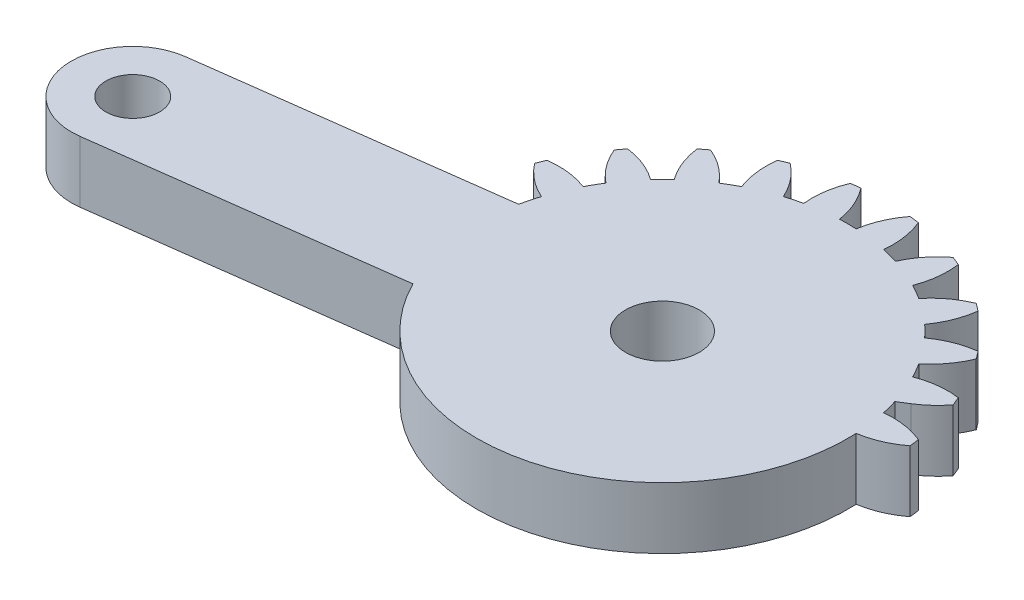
ISO-10303-21;
HEADER;
FILE_DESCRIPTION(('STEP AP214'),'2;1');
FILE_NAME('part.step','',(''),(''),'','','');
FILE_SCHEMA(('AUTOMOTIVE_DESIGN { 1 0 10303 214 1 1 1 1 }'));
ENDSEC;
DATA;
#1=APPLICATION_CONTEXT('core data for automotive mechanical design processes');
#2=APPLICATION_PROTOCOL_DEFINITION('international standard','automotive_design',2000,#1);
#3=PRODUCT_CONTEXT('',#1,'mechanical');
#4=PRODUCT('Part','Part','',(#3));
#5=PRODUCT_RELATED_PRODUCT_CATEGORY('part','',(#4));
#6=PRODUCT_DEFINITION_FORMATION('','',#4);
#7=PRODUCT_DEFINITION_CONTEXT('part definition',#1,'design');
#8=PRODUCT_DEFINITION('design','',#6,#7);
#9=PRODUCT_DEFINITION_SHAPE('','',#8);
#10=(LENGTH_UNIT() NAMED_UNIT(*) SI_UNIT(.MILLI.,.METRE.));
#11=(NAMED_UNIT(*) PLANE_ANGLE_UNIT() SI_UNIT($,.RADIAN.));
#12=(NAMED_UNIT(*) SI_UNIT($,.STERADIAN.) SOLID_ANGLE_UNIT());
#13=UNCERTAINTY_MEASURE_WITH_UNIT(LENGTH_MEASURE(1.E-05),#10,'distance_accuracy_value','');
#14=(GEOMETRIC_REPRESENTATION_CONTEXT(3) GLOBAL_UNCERTAINTY_ASSIGNED_CONTEXT((#13)) GLOBAL_UNIT_ASSIGNED_CONTEXT((#10,
#11,#12)) REPRESENTATION_CONTEXT('',''));
#15=CARTESIAN_POINT('',(0.,0.,0.));
#16=DIRECTION('',(0.,0.,1.));
#17=DIRECTION('',(1.,0.,0.));
#18=AXIS2_PLACEMENT_3D('',#15,#16,#17);
#19=CARTESIAN_POINT('',(20.6436574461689,4.,0.));
#20=DIRECTION('',(0.,1.,0.));
#21=DIRECTION('',(0.,0.,1.));
#22=AXIS2_PLACEMENT_3D('',#19,#20,#21);
#23=PLANE('',#22);
#24=CARTESIAN_POINT('',(-10.1063425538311,4.,0.));
#25=DIRECTION('',(0.,1.,0.));
#26=DIRECTION('',(0.,0.,1.));
#27=AXIS2_PLACEMENT_3D('',#24,#25,#26);
#28=CIRCLE('',#27,2.4);
#29=CARTESIAN_POINT('',(-10.1063425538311,4.,2.39999999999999));
#30=VERTEX_POINT('',#29);
#31=EDGE_CURVE('E742',#30,#30,#28,.T.);
#32=ORIENTED_EDGE('',*,*,#31,.F.);
#33=EDGE_LOOP('',(#32));
#34=FACE_BOUND('',#33,.T.);
#35=DIRECTION('',(-0.849390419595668,0.,0.527765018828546));
#36=VECTOR('',#35,1.);
#37=CARTESIAN_POINT('',(-1.21330216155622,4.,-1.95270090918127));
#38=LINE('',#37,#36);
#39=CARTESIAN_POINT('',(2.08164193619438,4.,-4.));
#40=VERTEX_POINT('',#39);
#41=CARTESIAN_POINT('',(1.43808022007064,4.,-3.60012574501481));
#42=VERTEX_POINT('',#41);
#43=EDGE_CURVE('E757',#40,#42,#38,.T.);
#44=ORIENTED_EDGE('',*,*,#43,.F.);
#45=CARTESIAN_POINT('',(-0.768289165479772,4.,-8.58670826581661));
#46=DIRECTION('',(0.,1.,0.));
#47=DIRECTION('',(0.,0.,1.));
#48=AXIS2_PLACEMENT_3D('',#45,#46,#47);
#49=CIRCLE('',#48,5.4);
#50=CARTESIAN_POINT('',(3.52174943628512,4.,-5.30713988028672));
#51=VERTEX_POINT('',#50);
#52=EDGE_CURVE('E171',#40,#51,#49,.T.);
#53=ORIENTED_EDGE('',*,*,#52,.T.);
#54=CARTESIAN_POINT('',(-10.1063425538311,4.,0.));
#55=DIRECTION('',(0.,1.,0.));
#56=DIRECTION('',(0.,0.,1.));
#57=AXIS2_PLACEMENT_3D('',#54,#55,#56);
#58=CIRCLE('',#57,14.625);
#59=CARTESIAN_POINT('',(3.28288830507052,4.,-5.88380166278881));
#60=VERTEX_POINT('',#59);
#61=EDGE_CURVE('E590',#51,#60,#58,.T.);
#62=ORIENTED_EDGE('',*,*,#61,.T.);
#63=CARTESIAN_POINT('',(2.56837796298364,4.,-0.531281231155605));
#64=DIRECTION('',(0.,1.,0.));
#65=DIRECTION('',(0.,0.,1.));
#66=AXIS2_PLACEMENT_3D('',#63,#64,#65);
#67=CIRCLE('',#66,5.4);
#68=CARTESIAN_POINT('',(0.627094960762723,4.,-5.5702712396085));
#69=VERTEX_POINT('',#68);
#70=EDGE_CURVE('E612',#60,#69,#67,.T.);
#71=ORIENTED_EDGE('',*,*,#70,.T.);
#72=CARTESIAN_POINT('',(-10.1063425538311,4.,0.));
#73=DIRECTION('',(0.,1.,0.));
#74=DIRECTION('',(0.,0.,1.));
#75=AXIS2_PLACEMENT_3D('',#72,#73,#74);
#76=CIRCLE('',#75,12.09275);
#77=CARTESIAN_POINT('',(0.0843726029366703,4.,-6.51029393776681));
#78=VERTEX_POINT('',#77);
#79=EDGE_CURVE('E608',#69,#78,#76,.T.);
#80=ORIENTED_EDGE('',*,*,#79,.T.);
#81=CARTESIAN_POINT('',(-3.308879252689,4.,-10.7109893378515));
#82=DIRECTION('',(0.,1.,0.));
#83=DIRECTION('',(0.,0.,1.));
#84=AXIS2_PLACEMENT_3D('',#81,#82,#83);
#85=CIRCLE('',#84,5.4);
#86=CARTESIAN_POINT('',(1.68379458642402,4.,-8.65351322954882));
#87=VERTEX_POINT('',#86);
#88=EDGE_CURVE('E611',#78,#87,#85,.T.);
#89=ORIENTED_EDGE('',*,*,#88,.T.);
#90=CARTESIAN_POINT('',(-10.1063425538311,4.,0.));
#91=DIRECTION('',(0.,1.,0.));
#92=DIRECTION('',(0.,0.,1.));
#93=AXIS2_PLACEMENT_3D('',#90,#91,#92);
#94=CIRCLE('',#93,14.625);
#95=CARTESIAN_POINT('',(1.30382139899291,4.,-9.1487039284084));
#96=VERTEX_POINT('',#95);
#97=EDGE_CURVE('E617',#87,#96,#94,.T.);
#98=ORIENTED_EDGE('',*,*,#97,.T.);
#99=CARTESIAN_POINT('',(1.9989916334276,4.,-3.79363732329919));
#100=DIRECTION('',(0.,1.,0.));
#101=DIRECTION('',(0.,0.,1.));
#102=AXIS2_PLACEMENT_3D('',#99,#100,#101);
#103=CIRCLE('',#102,5.4);
#104=CARTESIAN_POINT('',(-1.18033033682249,4.,-8.15848689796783));
#105=VERTEX_POINT('',#104);
#106=EDGE_CURVE('E625',#96,#105,#103,.T.);
#107=ORIENTED_EDGE('',*,*,#106,.T.);
#108=CARTESIAN_POINT('',(-10.1063425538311,4.,0.));
#109=DIRECTION('',(0.,1.,0.));
#110=DIRECTION('',(0.,0.,1.));
#111=AXIS2_PLACEMENT_3D('',#108,#109,#110);
#112=CIRCLE('',#111,12.09275);
#113=CARTESIAN_POINT('',(-1.9478556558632,4.,-8.92601221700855));
#114=VERTEX_POINT('',#113);
#115=EDGE_CURVE('E628',#105,#114,#112,.T.);
#116=ORIENTED_EDGE('',*,*,#115,.T.);
#117=CARTESIAN_POINT('',(-6.31270523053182,4.,-12.1053341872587));
#118=DIRECTION('',(0.,1.,0.));
#119=DIRECTION('',(0.,0.,1.));
#120=AXIS2_PLACEMENT_3D('',#117,#118,#119);
#121=CIRCLE('',#120,5.4);
#122=CARTESIAN_POINT('',(-0.957638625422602,4.,-11.4101639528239));
#123=VERTEX_POINT('',#122);
#124=EDGE_CURVE('E631',#114,#123,#121,.T.);
#125=ORIENTED_EDGE('',*,*,#124,.T.);
#126=CARTESIAN_POINT('',(-10.1063425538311,4.,0.));
#127=DIRECTION('',(0.,1.,0.));
#128=DIRECTION('',(0.,0.,1.));
#129=AXIS2_PLACEMENT_3D('',#126,#127,#128);
#130=CIRCLE('',#129,14.625);
#131=CARTESIAN_POINT('',(-1.45282932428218,4.,-11.7901371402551));
#132=VERTEX_POINT('',#131);
#133=EDGE_CURVE('E634',#123,#132,#130,.T.);
#134=ORIENTED_EDGE('',*,*,#133,.T.);
#135=CARTESIAN_POINT('',(0.604646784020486,4.,-6.79746330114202));
#136=DIRECTION('',(0.,1.,0.));
#137=DIRECTION('',(0.,0.,1.));
#138=AXIS2_PLACEMENT_3D('',#135,#136,#137);
#139=CIRCLE('',#138,5.4);
#140=CARTESIAN_POINT('',(-3.59604861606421,4.,-10.1907151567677));
#141=VERTEX_POINT('',#140);
#142=EDGE_CURVE('E637',#132,#141,#139,.T.);
#143=ORIENTED_EDGE('',*,*,#142,.T.);
#144=CARTESIAN_POINT('',(-10.1063425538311,4.,0.));
#145=DIRECTION('',(0.,1.,0.));
#146=DIRECTION('',(0.,0.,1.));
#147=AXIS2_PLACEMENT_3D('',#144,#145,#146);
#148=CIRCLE('',#147,12.09275);
#149=CARTESIAN_POINT('',(-4.53607131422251,4.,-10.7334375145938));
#150=VERTEX_POINT('',#149);
#151=EDGE_CURVE('E640',#141,#150,#148,.T.);
#152=ORIENTED_EDGE('',*,*,#151,.T.);
#153=CARTESIAN_POINT('',(-9.57506132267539,4.,-12.6747205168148));
#154=DIRECTION('',(0.,1.,0.));
#155=DIRECTION('',(0.,0.,1.));
#156=AXIS2_PLACEMENT_3D('',#153,#154,#155);
#157=CIRCLE('',#156,5.4);
#158=CARTESIAN_POINT('',(-4.22254089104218,4.,-13.3892308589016));
#159=VERTEX_POINT('',#158);
#160=EDGE_CURVE('E643',#150,#159,#157,.T.);
#161=ORIENTED_EDGE('',*,*,#160,.T.);
#162=CARTESIAN_POINT('',(-10.1063425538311,4.,0.));
#163=DIRECTION('',(0.,1.,0.));
#164=DIRECTION('',(0.,0.,1.));
#165=AXIS2_PLACEMENT_3D('',#162,#163,#164);
#166=CIRCLE('',#165,14.625);
#167=CARTESIAN_POINT('',(-4.79920267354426,4.,-13.6280919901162));
#168=VERTEX_POINT('',#167);
#169=EDGE_CURVE('E646',#159,#168,#166,.T.);
#170=ORIENTED_EDGE('',*,*,#169,.T.);
#171=CARTESIAN_POINT('',(-1.51963428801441,4.,-9.33805338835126));
#172=DIRECTION('',(0.,1.,0.));
#173=DIRECTION('',(0.,0.,1.));
#174=AXIS2_PLACEMENT_3D('',#171,#172,#173);
#175=CIRCLE('',#174,5.4);
#176=CARTESIAN_POINT('',(-6.45543266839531,4.,-11.528463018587));
#177=VERTEX_POINT('',#176);
#178=EDGE_CURVE('E649',#168,#177,#175,.T.);
#179=ORIENTED_EDGE('',*,*,#178,.T.);
#180=CARTESIAN_POINT('',(-10.1063425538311,4.,0.));
#181=DIRECTION('',(0.,1.,0.));
#182=DIRECTION('',(0.,0.,1.));
#183=AXIS2_PLACEMENT_3D('',#180,#181,#182);
#184=CIRCLE('',#183,12.09275);
#185=CARTESIAN_POINT('',(-7.50389175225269,4.,-11.8093967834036));
#186=VERTEX_POINT('',#185);
#187=EDGE_CURVE('E652',#177,#186,#184,.T.);
#188=ORIENTED_EDGE('',*,*,#187,.T.);
#189=CARTESIAN_POINT('',(-12.8736233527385,4.,-12.3803455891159));
#190=DIRECTION('',(0.,1.,0.));
#191=DIRECTION('',(0.,0.,1.));
#192=AXIS2_PLACEMENT_3D('',#189,#190,#191);
#193=CIRCLE('',#192,5.4);
#194=CARTESIAN_POINT('',(-7.88841451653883,4.,-14.4558438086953));
#195=VERTEX_POINT('',#194);
#196=EDGE_CURVE('E655',#186,#195,#193,.T.);
#197=ORIENTED_EDGE('',*,*,#196,.T.);
#198=CARTESIAN_POINT('',(-10.1063425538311,4.,0.));
#199=DIRECTION('',(0.,1.,0.));
#200=DIRECTION('',(0.,0.,1.));
#201=AXIS2_PLACEMENT_3D('',#198,#199,#200);
#202=CIRCLE('',#201,14.625);
#203=CARTESIAN_POINT('',(-8.50724883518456,4.,-14.5373148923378));
#204=VERTEX_POINT('',#203);
#205=EDGE_CURVE('E658',#195,#204,#202,.T.);
#206=ORIENTED_EDGE('',*,*,#205,.T.);
#207=CARTESIAN_POINT('',(-4.22908533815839,4.,-11.2422705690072));
#208=DIRECTION('',(0.,1.,0.));
#209=DIRECTION('',(0.,0.,1.));
#210=AXIS2_PLACEMENT_3D('',#207,#208,#209);
#211=CIRCLE('',#210,5.4);
#212=CARTESIAN_POINT('',(-9.56362019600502,4.,-12.0805651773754));
#213=VERTEX_POINT('',#212);
#214=EDGE_CURVE('E661',#204,#213,#211,.T.);
#215=ORIENTED_EDGE('',*,*,#214,.T.);
#216=CARTESIAN_POINT('',(-10.1063425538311,4.,0.));
#217=DIRECTION('',(0.,1.,0.));
#218=DIRECTION('',(0.,0.,1.));
#219=AXIS2_PLACEMENT_3D('',#216,#217,#218);
#220=CIRCLE('',#219,12.09275);
#221=CARTESIAN_POINT('',(-10.6490649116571,4.,-12.0805651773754));
#222=VERTEX_POINT('',#221);
#223=EDGE_CURVE('E664',#213,#222,#220,.T.);
#224=ORIENTED_EDGE('',*,*,#223,.T.);
#225=CARTESIAN_POINT('',(-15.9835997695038,4.,-11.2422705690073));
#226=DIRECTION('',(0.,1.,0.));
#227=DIRECTION('',(0.,0.,1.));
#228=AXIS2_PLACEMENT_3D('',#225,#226,#227);
#229=CIRCLE('',#228,5.4);
#230=CARTESIAN_POINT('',(-11.7054362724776,4.,-14.5373148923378));
#231=VERTEX_POINT('',#230);
#232=EDGE_CURVE('E667',#222,#231,#229,.T.);
#233=ORIENTED_EDGE('',*,*,#232,.T.);
#234=CARTESIAN_POINT('',(-10.1063425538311,4.,0.));
#235=DIRECTION('',(0.,1.,0.));
#236=DIRECTION('',(0.,0.,1.));
#237=AXIS2_PLACEMENT_3D('',#234,#235,#236);
#238=CIRCLE('',#237,14.625);
#239=CARTESIAN_POINT('',(-12.3242705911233,4.,-14.4558438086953));
#240=VERTEX_POINT('',#239);
#241=EDGE_CURVE('E670',#231,#240,#238,.T.);
#242=ORIENTED_EDGE('',*,*,#241,.T.);
#243=CARTESIAN_POINT('',(-7.33906175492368,4.,-12.3803455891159));
#244=DIRECTION('',(0.,1.,0.));
#245=DIRECTION('',(0.,0.,1.));
#246=AXIS2_PLACEMENT_3D('',#243,#244,#245);
#247=CIRCLE('',#246,5.4);
#248=CARTESIAN_POINT('',(-12.7087933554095,4.,-11.8093967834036));
#249=VERTEX_POINT('',#248);
#250=EDGE_CURVE('E672',#240,#249,#247,.T.);
#251=ORIENTED_EDGE('',*,*,#250,.T.);
#252=CARTESIAN_POINT('',(-10.1063425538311,4.,0.));
#253=DIRECTION('',(0.,1.,0.));
#254=DIRECTION('',(0.,0.,1.));
#255=AXIS2_PLACEMENT_3D('',#252,#253,#254);
#256=CIRCLE('',#255,12.09275);
#257=CARTESIAN_POINT('',(-13.7572524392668,4.,-11.528463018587));
#258=VERTEX_POINT('',#257);
#259=EDGE_CURVE('E675',#249,#258,#256,.T.);
#260=ORIENTED_EDGE('',*,*,#259,.T.);
#261=CARTESIAN_POINT('',(-18.6930508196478,4.,-9.33805338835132));
#262=DIRECTION('',(0.,1.,0.));
#263=DIRECTION('',(0.,0.,1.));
#264=AXIS2_PLACEMENT_3D('',#261,#262,#263);
#265=CIRCLE('',#264,5.4);
#266=CARTESIAN_POINT('',(-15.4134824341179,4.,-13.6280919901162));
#267=VERTEX_POINT('',#266);
#268=EDGE_CURVE('E678',#258,#267,#265,.T.);
#269=ORIENTED_EDGE('',*,*,#268,.T.);
#270=CARTESIAN_POINT('',(-10.1063425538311,4.,0.));
#271=DIRECTION('',(0.,1.,0.));
#272=DIRECTION('',(0.,0.,1.));
#273=AXIS2_PLACEMENT_3D('',#270,#271,#272);
#274=CIRCLE('',#273,14.625);
#275=CARTESIAN_POINT('',(-15.99014421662,4.,-13.3892308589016));
#276=VERTEX_POINT('',#275);
#277=EDGE_CURVE('E681',#267,#276,#274,.T.);
#278=ORIENTED_EDGE('',*,*,#277,.T.);
#279=CARTESIAN_POINT('',(-10.6376237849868,4.,-12.6747205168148));
#280=DIRECTION('',(0.,1.,0.));
#281=DIRECTION('',(0.,0.,1.));
#282=AXIS2_PLACEMENT_3D('',#279,#280,#281);
#283=CIRCLE('',#282,5.4);
#284=CARTESIAN_POINT('',(-15.6766137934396,4.,-10.7334375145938));
#285=VERTEX_POINT('',#284);
#286=EDGE_CURVE('E684',#276,#285,#283,.T.);
#287=ORIENTED_EDGE('',*,*,#286,.T.);
#288=CARTESIAN_POINT('',(-10.1063425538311,4.,0.));
#289=DIRECTION('',(0.,1.,0.));
#290=DIRECTION('',(0.,0.,1.));
#291=AXIS2_PLACEMENT_3D('',#288,#289,#290);
#292=CIRCLE('',#291,12.09275);
#293=CARTESIAN_POINT('',(-16.616636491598,4.,-10.1907151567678));
#294=VERTEX_POINT('',#293);
#295=EDGE_CURVE('E687',#285,#294,#292,.T.);
#296=ORIENTED_EDGE('',*,*,#295,.T.);
#297=CARTESIAN_POINT('',(-20.8173318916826,4.,-6.79746330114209));
#298=DIRECTION('',(0.,1.,0.));
#299=DIRECTION('',(0.,0.,1.));
#300=AXIS2_PLACEMENT_3D('',#297,#298,#299);
#301=CIRCLE('',#300,5.4);
#302=CARTESIAN_POINT('',(-18.75985578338,4.,-11.7901371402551));
#303=VERTEX_POINT('',#302);
#304=EDGE_CURVE('E690',#294,#303,#301,.T.);
#305=ORIENTED_EDGE('',*,*,#304,.T.);
#306=CARTESIAN_POINT('',(-10.1063425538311,4.,0.));
#307=DIRECTION('',(0.,1.,0.));
#308=DIRECTION('',(0.,0.,1.));
#309=AXIS2_PLACEMENT_3D('',#306,#307,#308);
#310=CIRCLE('',#309,14.625);
#311=CARTESIAN_POINT('',(-19.2550464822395,4.,-11.410163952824));
#312=VERTEX_POINT('',#311);
#313=EDGE_CURVE('E693',#303,#312,#310,.T.);
#314=ORIENTED_EDGE('',*,*,#313,.T.);
#315=CARTESIAN_POINT('',(-13.8999798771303,4.,-12.1053341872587));
#316=DIRECTION('',(0.,1.,0.));
#317=DIRECTION('',(0.,0.,1.));
#318=AXIS2_PLACEMENT_3D('',#315,#316,#317);
#319=CIRCLE('',#318,5.4);
#320=CARTESIAN_POINT('',(-18.264829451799,4.,-8.92601221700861));
#321=VERTEX_POINT('',#320);
#322=EDGE_CURVE('E696',#312,#321,#319,.T.);
#323=ORIENTED_EDGE('',*,*,#322,.T.);
#324=CARTESIAN_POINT('',(-10.1063425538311,4.,0.));
#325=DIRECTION('',(0.,1.,0.));
#326=DIRECTION('',(0.,0.,1.));
#327=AXIS2_PLACEMENT_3D('',#324,#325,#326);
#328=CIRCLE('',#327,12.09275);
#329=CARTESIAN_POINT('',(-19.0323547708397,4.,-8.15848689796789));
#330=VERTEX_POINT('',#329);
#331=EDGE_CURVE('E699',#321,#330,#328,.T.);
#332=ORIENTED_EDGE('',*,*,#331,.T.);
#333=CARTESIAN_POINT('',(-22.2116767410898,4.,-3.79363732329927));
#334=DIRECTION('',(0.,1.,0.));
#335=DIRECTION('',(0.,0.,1.));
#336=AXIS2_PLACEMENT_3D('',#333,#334,#335);
#337=CIRCLE('',#336,5.4);
#338=CARTESIAN_POINT('',(-21.5165065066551,4.,-9.14870392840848));
#339=VERTEX_POINT('',#338);
#340=EDGE_CURVE('E702',#330,#339,#337,.T.);
#341=ORIENTED_EDGE('',*,*,#340,.T.);
#342=CARTESIAN_POINT('',(-10.1063425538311,4.,0.));
#343=DIRECTION('',(0.,1.,0.));
#344=DIRECTION('',(0.,0.,1.));
#345=AXIS2_PLACEMENT_3D('',#342,#343,#344);
#346=CIRCLE('',#345,14.625);
#347=CARTESIAN_POINT('',(-21.8964796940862,4.,-8.65351322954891));
#348=VERTEX_POINT('',#347);
#349=EDGE_CURVE('E705',#339,#348,#346,.T.);
#350=ORIENTED_EDGE('',*,*,#349,.T.);
#351=CARTESIAN_POINT('',(-16.9038058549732,4.,-10.7109893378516));
#352=DIRECTION('',(0.,1.,0.));
#353=DIRECTION('',(0.,0.,1.));
#354=AXIS2_PLACEMENT_3D('',#351,#352,#353);
#355=CIRCLE('',#354,5.4);
#356=CARTESIAN_POINT('',(-20.2970577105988,4.,-6.51029393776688));
#357=VERTEX_POINT('',#356);
#358=EDGE_CURVE('E708',#348,#357,#355,.T.);
#359=ORIENTED_EDGE('',*,*,#358,.T.);
#360=CARTESIAN_POINT('',(-10.1063425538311,4.,0.));
#361=DIRECTION('',(0.,1.,0.));
#362=DIRECTION('',(0.,0.,1.));
#363=AXIS2_PLACEMENT_3D('',#360,#361,#362);
#364=CIRCLE('',#363,12.09275);
#365=CARTESIAN_POINT('',(-20.8397800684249,4.,-5.57027123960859));
#366=VERTEX_POINT('',#365);
#367=EDGE_CURVE('E287',#357,#366,#364,.T.);
#368=ORIENTED_EDGE('',*,*,#367,.T.);
#369=CARTESIAN_POINT('',(-22.7810630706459,4.,-0.531281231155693));
#370=DIRECTION('',(0.,1.,0.));
#371=DIRECTION('',(0.,0.,1.));
#372=AXIS2_PLACEMENT_3D('',#369,#370,#371);
#373=CIRCLE('',#372,5.4);
#374=CARTESIAN_POINT('',(-23.4955734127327,4.,-5.8838016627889));
#375=VERTEX_POINT('',#374);
#376=EDGE_CURVE('E281',#366,#375,#373,.T.);
#377=ORIENTED_EDGE('',*,*,#376,.T.);
#378=CARTESIAN_POINT('',(-10.1063425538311,4.,0.));
#379=DIRECTION('',(0.,1.,0.));
#380=DIRECTION('',(0.,0.,1.));
#381=AXIS2_PLACEMENT_3D('',#378,#379,#380);
#382=CIRCLE('',#381,14.625);
#383=CARTESIAN_POINT('',(-23.7344345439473,4.,-5.30713988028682));
#384=VERTEX_POINT('',#383);
#385=EDGE_CURVE('E285',#375,#384,#382,.T.);
#386=ORIENTED_EDGE('',*,*,#385,.T.);
#387=CARTESIAN_POINT('',(-19.4443959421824,4.,-8.58670826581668));
#388=DIRECTION('',(0.,1.,0.));
#389=DIRECTION('',(0.,0.,1.));
#390=AXIS2_PLACEMENT_3D('',#387,#388,#389);
#391=CIRCLE('',#390,5.4);
#392=CARTESIAN_POINT('',(-21.6348055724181,4.,-3.65090988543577));
#393=VERTEX_POINT('',#392);
#394=EDGE_CURVE('E34',#384,#393,#391,.T.);
#395=ORIENTED_EDGE('',*,*,#394,.T.);
#396=CARTESIAN_POINT('',(-10.1063425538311,4.,0.));
#397=DIRECTION('',(0.,1.,0.));
#398=DIRECTION('',(0.,0.,1.));
#399=AXIS2_PLACEMENT_3D('',#396,#397,#398);
#400=CIRCLE('',#399,12.09275);
#401=CARTESIAN_POINT('',(-21.9428533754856,4.,-2.47620962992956));
#402=VERTEX_POINT('',#401);
#403=EDGE_CURVE('E308',#393,#402,#400,.T.);
#404=ORIENTED_EDGE('',*,*,#403,.T.);
#405=DIRECTION('',(-0.99144486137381,0.,0.130526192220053));
#406=VECTOR('',#405,1.);
#407=CARTESIAN_POINT('',(-0.694287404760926,4.,-5.27363641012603));
#408=LINE('',#407,#406);
#409=CARTESIAN_POINT('',(-41.115376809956,4.,0.0479009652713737));
#410=VERTEX_POINT('',#409);
#411=EDGE_CURVE('E769',#402,#410,#408,.T.);
#412=ORIENTED_EDGE('',*,*,#411,.T.);
#413=CARTESIAN_POINT('',(-40.5932720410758,4.,4.01368041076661));
#414=DIRECTION('',(0.,1.,0.));
#415=DIRECTION('',(0.,0.,1.));
#416=AXIS2_PLACEMENT_3D('',#413,#414,#415);
#417=CIRCLE('',#416,4.);
#418=CARTESIAN_POINT('',(-40.0711672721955,4.,7.97945985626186));
#419=VERTEX_POINT('',#418);
#420=EDGE_CURVE('E771',#410,#419,#417,.T.);
#421=ORIENTED_EDGE('',*,*,#420,.T.);
#422=DIRECTION('',(-0.99144486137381,0.,0.130526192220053));
#423=VECTOR('',#422,1.);
#424=CARTESIAN_POINT('',(0.349922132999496,4.,2.65792248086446));
#425=LINE('',#424,#423);
#426=CARTESIAN_POINT('',(-20.8986438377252,4.,5.45534926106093));
#427=VERTEX_POINT('',#426);
#428=EDGE_CURVE('E749',#427,#419,#425,.T.);
#429=ORIENTED_EDGE('',*,*,#428,.F.);
#430=CARTESIAN_POINT('',(-10.1063425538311,4.,0.));
#431=DIRECTION('',(0.,1.,0.));
#432=DIRECTION('',(0.,0.,1.));
#433=AXIS2_PLACEMENT_3D('',#430,#431,#432);
#434=CIRCLE('',#433,12.09275);
#435=CARTESIAN_POINT('',(1.9742226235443,4.,-0.542722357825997));
#436=VERTEX_POINT('',#435);
#437=EDGE_CURVE('E314',#427,#436,#434,.T.);
#438=ORIENTED_EDGE('',*,*,#437,.T.);
#439=CARTESIAN_POINT('',(1.13592801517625,4.,-5.87725721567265));
#440=DIRECTION('',(0.,1.,0.));
#441=DIRECTION('',(0.,0.,1.));
#442=AXIS2_PLACEMENT_3D('',#439,#440,#441);
#443=CIRCLE('',#442,5.4);
#444=CARTESIAN_POINT('',(4.43097233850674,4.,-1.59909371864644));
#445=VERTEX_POINT('',#444);
#446=EDGE_CURVE('E755',#436,#445,#443,.T.);
#447=ORIENTED_EDGE('',*,*,#446,.T.);
#448=CARTESIAN_POINT('',(-10.1063425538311,4.,0.));
#449=DIRECTION('',(0.,1.,0.));
#450=DIRECTION('',(0.,0.,1.));
#451=AXIS2_PLACEMENT_3D('',#448,#449,#450);
#452=CIRCLE('',#451,14.625);
#453=CARTESIAN_POINT('',(4.34950125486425,4.,-2.21792803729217));
#454=VERTEX_POINT('',#453);
#455=EDGE_CURVE('E741',#445,#454,#452,.T.);
#456=ORIENTED_EDGE('',*,*,#455,.T.);
#457=CARTESIAN_POINT('',(2.27400303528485,4.,2.76728079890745));
#458=DIRECTION('',(0.,1.,0.));
#459=DIRECTION('',(0.,0.,1.));
#460=AXIS2_PLACEMENT_3D('',#457,#458,#459);
#461=CIRCLE('',#460,5.4);
#462=CARTESIAN_POINT('',(1.70305422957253,4.,-2.60245080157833));
#463=VERTEX_POINT('',#462);
#464=EDGE_CURVE('E865',#454,#463,#461,.T.);
#465=ORIENTED_EDGE('',*,*,#464,.T.);
#466=CARTESIAN_POINT('',(-10.1063425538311,4.,0.));
#467=DIRECTION('',(0.,1.,0.));
#468=DIRECTION('',(0.,0.,1.));
#469=AXIS2_PLACEMENT_3D('',#466,#467,#468);
#470=CIRCLE('',#469,12.09275);
#471=EDGE_CURVE('E869',#463,#42,#470,.T.);
#472=ORIENTED_EDGE('',*,*,#471,.T.);
#473=EDGE_LOOP('',(#44,#53,#62,#71,#80,#89,#98,#107,#116,#125,#134,#143,#152,#161,#170,#179,
#188,#197,#206,#215,#224,#233,#242,#251,#260,#269,#278,#287,#296,#305,#314,#323,#332,#341,#350,
#359,#368,#377,#386,#395,#404,#412,#421,#429,#438,#447,#456,#465,#472));
#474=FACE_BOUND('',#473,.T.);
#475=CARTESIAN_POINT('',(-40.5932720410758,4.,4.01368041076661));
#476=DIRECTION('',(0.,1.,0.));
#477=DIRECTION('',(0.,0.,1.));
#478=AXIS2_PLACEMENT_3D('',#475,#476,#477);
#479=CIRCLE('',#478,1.75);
#480=CARTESIAN_POINT('',(-40.5932720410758,4.,5.76368041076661));
#481=VERTEX_POINT('',#480);
#482=EDGE_CURVE('E778',#481,#481,#479,.T.);
#483=ORIENTED_EDGE('',*,*,#482,.F.);
#484=EDGE_LOOP('',(#483));
#485=FACE_BOUND('',#484,.T.);
#486=ADVANCED_FACE('F16',(#34,#474,#485),#23,.T.);
#487=CARTESIAN_POINT('',(20.6436574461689,0.,0.));
#488=DIRECTION('',(0.,1.,0.));
#489=DIRECTION('',(0.,0.,1.));
#490=AXIS2_PLACEMENT_3D('',#487,#488,#489);
#491=PLANE('',#490);
#492=CARTESIAN_POINT('',(-10.1063425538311,0.,0.));
#493=DIRECTION('',(0.,1.,0.));
#494=DIRECTION('',(0.,0.,1.));
#495=AXIS2_PLACEMENT_3D('',#492,#493,#494);
#496=CIRCLE('',#495,2.4);
#497=CARTESIAN_POINT('',(-10.1063425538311,0.,2.39999999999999));
#498=VERTEX_POINT('',#497);
#499=EDGE_CURVE('E739',#498,#498,#496,.F.);
#500=ORIENTED_EDGE('',*,*,#499,.F.);
#501=EDGE_LOOP('',(#500));
#502=FACE_BOUND('',#501,.T.);
#503=CARTESIAN_POINT('',(-40.5932720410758,0.,4.01368041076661));
#504=DIRECTION('',(0.,1.,0.));
#505=DIRECTION('',(0.,0.,1.));
#506=AXIS2_PLACEMENT_3D('',#503,#504,#505);
#507=CIRCLE('',#506,1.75);
#508=CARTESIAN_POINT('',(-40.5932720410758,0.,5.76368041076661));
#509=VERTEX_POINT('',#508);
#510=EDGE_CURVE('E728',#509,#509,#507,.T.);
#511=ORIENTED_EDGE('',*,*,#510,.T.);
#512=EDGE_LOOP('',(#511));
#513=FACE_BOUND('',#512,.T.);
#514=CARTESIAN_POINT('',(-0.768289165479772,0.,-8.58670826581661));
#515=DIRECTION('',(0.,1.,0.));
#516=DIRECTION('',(0.,0.,1.));
#517=AXIS2_PLACEMENT_3D('',#514,#515,#516);
#518=CIRCLE('',#517,5.4);
#519=CARTESIAN_POINT('',(2.08164193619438,0.,-4.));
#520=VERTEX_POINT('',#519);
#521=CARTESIAN_POINT('',(3.52174943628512,0.,-5.30713988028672));
#522=VERTEX_POINT('',#521);
#523=EDGE_CURVE('E319',#520,#522,#518,.T.);
#524=ORIENTED_EDGE('',*,*,#523,.F.);
#525=DIRECTION('',(-0.849390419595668,0.,0.527765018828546));
#526=VECTOR('',#525,1.);
#527=CARTESIAN_POINT('',(-1.21330216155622,0.,-1.95270090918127));
#528=LINE('',#527,#526);
#529=CARTESIAN_POINT('',(1.43808022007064,0.,-3.60012574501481));
#530=VERTEX_POINT('',#529);
#531=EDGE_CURVE('E767',#520,#530,#528,.T.);
#532=ORIENTED_EDGE('',*,*,#531,.T.);
#533=CARTESIAN_POINT('',(-10.1063425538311,0.,0.));
#534=DIRECTION('',(0.,1.,0.));
#535=DIRECTION('',(0.,0.,1.));
#536=AXIS2_PLACEMENT_3D('',#533,#534,#535);
#537=CIRCLE('',#536,12.09275);
#538=CARTESIAN_POINT('',(1.70305422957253,0.,-2.60245080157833));
#539=VERTEX_POINT('',#538);
#540=EDGE_CURVE('E764',#539,#530,#537,.T.);
#541=ORIENTED_EDGE('',*,*,#540,.F.);
#542=CARTESIAN_POINT('',(2.27400303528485,0.,2.76728079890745));
#543=DIRECTION('',(0.,1.,0.));
#544=DIRECTION('',(0.,0.,1.));
#545=AXIS2_PLACEMENT_3D('',#542,#543,#544);
#546=CIRCLE('',#545,5.4);
#547=CARTESIAN_POINT('',(4.34950125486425,0.,-2.21792803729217));
#548=VERTEX_POINT('',#547);
#549=EDGE_CURVE('E761',#548,#539,#546,.T.);
#550=ORIENTED_EDGE('',*,*,#549,.F.);
#551=CARTESIAN_POINT('',(-10.1063425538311,0.,0.));
#552=DIRECTION('',(0.,1.,0.));
#553=DIRECTION('',(0.,0.,1.));
#554=AXIS2_PLACEMENT_3D('',#551,#552,#553);
#555=CIRCLE('',#554,14.625);
#556=CARTESIAN_POINT('',(4.43097233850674,0.,-1.59909371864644));
#557=VERTEX_POINT('',#556);
#558=EDGE_CURVE('E857',#557,#548,#555,.T.);
#559=ORIENTED_EDGE('',*,*,#558,.F.);
#560=CARTESIAN_POINT('',(1.13592801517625,0.,-5.87725721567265));
#561=DIRECTION('',(0.,1.,0.));
#562=DIRECTION('',(0.,0.,1.));
#563=AXIS2_PLACEMENT_3D('',#560,#561,#562);
#564=CIRCLE('',#563,5.4);
#565=CARTESIAN_POINT('',(1.9742226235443,0.,-0.542722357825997));
#566=VERTEX_POINT('',#565);
#567=EDGE_CURVE('E851',#566,#557,#564,.T.);
#568=ORIENTED_EDGE('',*,*,#567,.F.);
#569=CARTESIAN_POINT('',(-10.1063425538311,0.,0.));
#570=DIRECTION('',(0.,1.,0.));
#571=DIRECTION('',(0.,0.,1.));
#572=AXIS2_PLACEMENT_3D('',#569,#570,#571);
#573=CIRCLE('',#572,12.09275);
#574=CARTESIAN_POINT('',(-20.8986438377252,0.,5.45534926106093));
#575=VERTEX_POINT('',#574);
#576=EDGE_CURVE('E438',#575,#566,#573,.T.);
#577=ORIENTED_EDGE('',*,*,#576,.F.);
#578=DIRECTION('',(-0.99144486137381,0.,0.130526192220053));
#579=VECTOR('',#578,1.);
#580=CARTESIAN_POINT('',(0.349922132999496,0.,2.65792248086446));
#581=LINE('',#580,#579);
#582=CARTESIAN_POINT('',(-40.0711672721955,0.,7.97945985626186));
#583=VERTEX_POINT('',#582);
#584=EDGE_CURVE('E724',#575,#583,#581,.T.);
#585=ORIENTED_EDGE('',*,*,#584,.T.);
#586=CARTESIAN_POINT('',(-40.5932720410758,0.,4.01368041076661));
#587=DIRECTION('',(0.,1.,0.));
#588=DIRECTION('',(0.,0.,1.));
#589=AXIS2_PLACEMENT_3D('',#586,#587,#588);
#590=CIRCLE('',#589,4.);
#591=CARTESIAN_POINT('',(-41.115376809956,0.,0.0479009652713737));
#592=VERTEX_POINT('',#591);
#593=EDGE_CURVE('E723',#592,#583,#590,.T.);
#594=ORIENTED_EDGE('',*,*,#593,.F.);
#595=DIRECTION('',(-0.99144486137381,0.,0.130526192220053));
#596=VECTOR('',#595,1.);
#597=CARTESIAN_POINT('',(-0.694287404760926,0.,-5.27363641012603));
#598=LINE('',#597,#596);
#599=CARTESIAN_POINT('',(-21.9428533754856,0.,-2.47620962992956));
#600=VERTEX_POINT('',#599);
#601=EDGE_CURVE('E721',#600,#592,#598,.T.);
#602=ORIENTED_EDGE('',*,*,#601,.F.);
#603=CARTESIAN_POINT('',(-10.1063425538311,0.,0.));
#604=DIRECTION('',(0.,1.,0.));
#605=DIRECTION('',(0.,0.,1.));
#606=AXIS2_PLACEMENT_3D('',#603,#604,#605);
#607=CIRCLE('',#606,12.09275);
#608=CARTESIAN_POINT('',(-21.6348055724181,0.,-3.65090988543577));
#609=VERTEX_POINT('',#608);
#610=EDGE_CURVE('E434',#609,#600,#607,.T.);
#611=ORIENTED_EDGE('',*,*,#610,.F.);
#612=CARTESIAN_POINT('',(-19.4443959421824,0.,-8.58670826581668));
#613=DIRECTION('',(0.,1.,0.));
#614=DIRECTION('',(0.,0.,1.));
#615=AXIS2_PLACEMENT_3D('',#612,#613,#614);
#616=CIRCLE('',#615,5.4);
#617=CARTESIAN_POINT('',(-23.7344345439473,0.,-5.30713988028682));
#618=VERTEX_POINT('',#617);
#619=EDGE_CURVE('E163',#618,#609,#616,.T.);
#620=ORIENTED_EDGE('',*,*,#619,.F.);
#621=CARTESIAN_POINT('',(-10.1063425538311,0.,0.));
#622=DIRECTION('',(0.,1.,0.));
#623=DIRECTION('',(0.,0.,1.));
#624=AXIS2_PLACEMENT_3D('',#621,#622,#623);
#625=CIRCLE('',#624,14.625);
#626=CARTESIAN_POINT('',(-23.4955734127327,0.,-5.8838016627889));
#627=VERTEX_POINT('',#626);
#628=EDGE_CURVE('E157',#627,#618,#625,.T.);
#629=ORIENTED_EDGE('',*,*,#628,.F.);
#630=CARTESIAN_POINT('',(-22.7810630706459,0.,-0.531281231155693));
#631=DIRECTION('',(0.,1.,0.));
#632=DIRECTION('',(0.,0.,1.));
#633=AXIS2_PLACEMENT_3D('',#630,#631,#632);
#634=CIRCLE('',#633,5.4);
#635=CARTESIAN_POINT('',(-20.8397800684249,0.,-5.57027123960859));
#636=VERTEX_POINT('',#635);
#637=EDGE_CURVE('E296',#636,#627,#634,.T.);
#638=ORIENTED_EDGE('',*,*,#637,.F.);
#639=CARTESIAN_POINT('',(-10.1063425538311,0.,0.));
#640=DIRECTION('',(0.,1.,0.));
#641=DIRECTION('',(0.,0.,1.));
#642=AXIS2_PLACEMENT_3D('',#639,#640,#641);
#643=CIRCLE('',#642,12.09275);
#644=CARTESIAN_POINT('',(-20.2970577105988,0.,-6.51029393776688));
#645=VERTEX_POINT('',#644);
#646=EDGE_CURVE('E425',#645,#636,#643,.T.);
#647=ORIENTED_EDGE('',*,*,#646,.F.);
#648=CARTESIAN_POINT('',(-16.9038058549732,0.,-10.7109893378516));
#649=DIRECTION('',(0.,1.,0.));
#650=DIRECTION('',(0.,0.,1.));
#651=AXIS2_PLACEMENT_3D('',#648,#649,#650);
#652=CIRCLE('',#651,5.4);
#653=CARTESIAN_POINT('',(-21.8964796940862,0.,-8.65351322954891));
#654=VERTEX_POINT('',#653);
#655=EDGE_CURVE('E422',#654,#645,#652,.T.);
#656=ORIENTED_EDGE('',*,*,#655,.F.);
#657=CARTESIAN_POINT('',(-10.1063425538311,0.,0.));
#658=DIRECTION('',(0.,1.,0.));
#659=DIRECTION('',(0.,0.,1.));
#660=AXIS2_PLACEMENT_3D('',#657,#658,#659);
#661=CIRCLE('',#660,14.625);
#662=CARTESIAN_POINT('',(-21.5165065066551,0.,-9.14870392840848));
#663=VERTEX_POINT('',#662);
#664=EDGE_CURVE('E419',#663,#654,#661,.T.);
#665=ORIENTED_EDGE('',*,*,#664,.F.);
#666=CARTESIAN_POINT('',(-22.2116767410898,0.,-3.79363732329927));
#667=DIRECTION('',(0.,1.,0.));
#668=DIRECTION('',(0.,0.,1.));
#669=AXIS2_PLACEMENT_3D('',#666,#667,#668);
#670=CIRCLE('',#669,5.4);
#671=CARTESIAN_POINT('',(-19.0323547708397,0.,-8.15848689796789));
#672=VERTEX_POINT('',#671);
#673=EDGE_CURVE('E416',#672,#663,#670,.T.);
#674=ORIENTED_EDGE('',*,*,#673,.F.);
#675=CARTESIAN_POINT('',(-10.1063425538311,0.,0.));
#676=DIRECTION('',(0.,1.,0.));
#677=DIRECTION('',(0.,0.,1.));
#678=AXIS2_PLACEMENT_3D('',#675,#676,#677);
#679=CIRCLE('',#678,12.09275);
#680=CARTESIAN_POINT('',(-18.264829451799,0.,-8.92601221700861));
#681=VERTEX_POINT('',#680);
#682=EDGE_CURVE('E413',#681,#672,#679,.T.);
#683=ORIENTED_EDGE('',*,*,#682,.F.);
#684=CARTESIAN_POINT('',(-13.8999798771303,0.,-12.1053341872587));
#685=DIRECTION('',(0.,1.,0.));
#686=DIRECTION('',(0.,0.,1.));
#687=AXIS2_PLACEMENT_3D('',#684,#685,#686);
#688=CIRCLE('',#687,5.4);
#689=CARTESIAN_POINT('',(-19.2550464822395,0.,-11.410163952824));
#690=VERTEX_POINT('',#689);
#691=EDGE_CURVE('E410',#690,#681,#688,.T.);
#692=ORIENTED_EDGE('',*,*,#691,.F.);
#693=CARTESIAN_POINT('',(-10.1063425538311,0.,0.));
#694=DIRECTION('',(0.,1.,0.));
#695=DIRECTION('',(0.,0.,1.));
#696=AXIS2_PLACEMENT_3D('',#693,#694,#695);
#697=CIRCLE('',#696,14.625);
#698=CARTESIAN_POINT('',(-18.75985578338,0.,-11.7901371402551));
#699=VERTEX_POINT('',#698);
#700=EDGE_CURVE('E407',#699,#690,#697,.T.);
#701=ORIENTED_EDGE('',*,*,#700,.F.);
#702=CARTESIAN_POINT('',(-20.8173318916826,0.,-6.79746330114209));
#703=DIRECTION('',(0.,1.,0.));
#704=DIRECTION('',(0.,0.,1.));
#705=AXIS2_PLACEMENT_3D('',#702,#703,#704);
#706=CIRCLE('',#705,5.4);
#707=CARTESIAN_POINT('',(-16.616636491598,0.,-10.1907151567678));
#708=VERTEX_POINT('',#707);
#709=EDGE_CURVE('E404',#708,#699,#706,.T.);
#710=ORIENTED_EDGE('',*,*,#709,.F.);
#711=CARTESIAN_POINT('',(-10.1063425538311,0.,0.));
#712=DIRECTION('',(0.,1.,0.));
#713=DIRECTION('',(0.,0.,1.));
#714=AXIS2_PLACEMENT_3D('',#711,#712,#713);
#715=CIRCLE('',#714,12.09275);
#716=CARTESIAN_POINT('',(-15.6766137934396,0.,-10.7334375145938));
#717=VERTEX_POINT('',#716);
#718=EDGE_CURVE('E401',#717,#708,#715,.T.);
#719=ORIENTED_EDGE('',*,*,#718,.F.);
#720=CARTESIAN_POINT('',(-10.6376237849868,0.,-12.6747205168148));
#721=DIRECTION('',(0.,1.,0.));
#722=DIRECTION('',(0.,0.,1.));
#723=AXIS2_PLACEMENT_3D('',#720,#721,#722);
#724=CIRCLE('',#723,5.4);
#725=CARTESIAN_POINT('',(-15.99014421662,0.,-13.3892308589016));
#726=VERTEX_POINT('',#725);
#727=EDGE_CURVE('E398',#726,#717,#724,.T.);
#728=ORIENTED_EDGE('',*,*,#727,.F.);
#729=CARTESIAN_POINT('',(-10.1063425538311,0.,0.));
#730=DIRECTION('',(0.,1.,0.));
#731=DIRECTION('',(0.,0.,1.));
#732=AXIS2_PLACEMENT_3D('',#729,#730,#731);
#733=CIRCLE('',#732,14.625);
#734=CARTESIAN_POINT('',(-15.4134824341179,0.,-13.6280919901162));
#735=VERTEX_POINT('',#734);
#736=EDGE_CURVE('E395',#735,#726,#733,.T.);
#737=ORIENTED_EDGE('',*,*,#736,.F.);
#738=CARTESIAN_POINT('',(-18.6930508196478,0.,-9.33805338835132));
#739=DIRECTION('',(0.,1.,0.));
#740=DIRECTION('',(0.,0.,1.));
#741=AXIS2_PLACEMENT_3D('',#738,#739,#740);
#742=CIRCLE('',#741,5.4);
#743=CARTESIAN_POINT('',(-13.7572524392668,0.,-11.528463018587));
#744=VERTEX_POINT('',#743);
#745=EDGE_CURVE('E392',#744,#735,#742,.T.);
#746=ORIENTED_EDGE('',*,*,#745,.F.);
#747=CARTESIAN_POINT('',(-10.1063425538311,0.,0.));
#748=DIRECTION('',(0.,1.,0.));
#749=DIRECTION('',(0.,0.,1.));
#750=AXIS2_PLACEMENT_3D('',#747,#748,#749);
#751=CIRCLE('',#750,12.09275);
#752=CARTESIAN_POINT('',(-12.7087933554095,0.,-11.8093967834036));
#753=VERTEX_POINT('',#752);
#754=EDGE_CURVE('E389',#753,#744,#751,.T.);
#755=ORIENTED_EDGE('',*,*,#754,.F.);
#756=CARTESIAN_POINT('',(-7.33906175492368,0.,-12.3803455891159));
#757=DIRECTION('',(0.,1.,0.));
#758=DIRECTION('',(0.,0.,1.));
#759=AXIS2_PLACEMENT_3D('',#756,#757,#758);
#760=CIRCLE('',#759,5.4);
#761=CARTESIAN_POINT('',(-12.3242705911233,0.,-14.4558438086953));
#762=VERTEX_POINT('',#761);
#763=EDGE_CURVE('E386',#762,#753,#760,.T.);
#764=ORIENTED_EDGE('',*,*,#763,.F.);
#765=CARTESIAN_POINT('',(-10.1063425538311,0.,0.));
#766=DIRECTION('',(0.,1.,0.));
#767=DIRECTION('',(0.,0.,1.));
#768=AXIS2_PLACEMENT_3D('',#765,#766,#767);
#769=CIRCLE('',#768,14.625);
#770=CARTESIAN_POINT('',(-11.7054362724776,0.,-14.5373148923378));
#771=VERTEX_POINT('',#770);
#772=EDGE_CURVE('E383',#771,#762,#769,.T.);
#773=ORIENTED_EDGE('',*,*,#772,.F.);
#774=CARTESIAN_POINT('',(-15.9835997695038,0.,-11.2422705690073));
#775=DIRECTION('',(0.,1.,0.));
#776=DIRECTION('',(0.,0.,1.));
#777=AXIS2_PLACEMENT_3D('',#774,#775,#776);
#778=CIRCLE('',#777,5.4);
#779=CARTESIAN_POINT('',(-10.6490649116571,0.,-12.0805651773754));
#780=VERTEX_POINT('',#779);
#781=EDGE_CURVE('E380',#780,#771,#778,.T.);
#782=ORIENTED_EDGE('',*,*,#781,.F.);
#783=CARTESIAN_POINT('',(-10.1063425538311,0.,0.));
#784=DIRECTION('',(0.,1.,0.));
#785=DIRECTION('',(0.,0.,1.));
#786=AXIS2_PLACEMENT_3D('',#783,#784,#785);
#787=CIRCLE('',#786,12.09275);
#788=CARTESIAN_POINT('',(-9.56362019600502,0.,-12.0805651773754));
#789=VERTEX_POINT('',#788);
#790=EDGE_CURVE('E377',#789,#780,#787,.T.);
#791=ORIENTED_EDGE('',*,*,#790,.F.);
#792=CARTESIAN_POINT('',(-4.22908533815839,0.,-11.2422705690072));
#793=DIRECTION('',(0.,1.,0.));
#794=DIRECTION('',(0.,0.,1.));
#795=AXIS2_PLACEMENT_3D('',#792,#793,#794);
#796=CIRCLE('',#795,5.4);
#797=CARTESIAN_POINT('',(-8.50724883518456,0.,-14.5373148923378));
#798=VERTEX_POINT('',#797);
#799=EDGE_CURVE('E374',#798,#789,#796,.T.);
#800=ORIENTED_EDGE('',*,*,#799,.F.);
#801=CARTESIAN_POINT('',(-10.1063425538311,0.,0.));
#802=DIRECTION('',(0.,1.,0.));
#803=DIRECTION('',(0.,0.,1.));
#804=AXIS2_PLACEMENT_3D('',#801,#802,#803);
#805=CIRCLE('',#804,14.625);
#806=CARTESIAN_POINT('',(-7.88841451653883,0.,-14.4558438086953));
#807=VERTEX_POINT('',#806);
#808=EDGE_CURVE('E371',#807,#798,#805,.T.);
#809=ORIENTED_EDGE('',*,*,#808,.F.);
#810=CARTESIAN_POINT('',(-12.8736233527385,0.,-12.3803455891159));
#811=DIRECTION('',(0.,1.,0.));
#812=DIRECTION('',(0.,0.,1.));
#813=AXIS2_PLACEMENT_3D('',#810,#811,#812);
#814=CIRCLE('',#813,5.4);
#815=CARTESIAN_POINT('',(-7.50389175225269,0.,-11.8093967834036));
#816=VERTEX_POINT('',#815);
#817=EDGE_CURVE('E368',#816,#807,#814,.T.);
#818=ORIENTED_EDGE('',*,*,#817,.F.);
#819=CARTESIAN_POINT('',(-10.1063425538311,0.,0.));
#820=DIRECTION('',(0.,1.,0.));
#821=DIRECTION('',(0.,0.,1.));
#822=AXIS2_PLACEMENT_3D('',#819,#820,#821);
#823=CIRCLE('',#822,12.09275);
#824=CARTESIAN_POINT('',(-6.45543266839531,0.,-11.528463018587));
#825=VERTEX_POINT('',#824);
#826=EDGE_CURVE('E365',#825,#816,#823,.T.);
#827=ORIENTED_EDGE('',*,*,#826,.F.);
#828=CARTESIAN_POINT('',(-1.51963428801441,0.,-9.33805338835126));
#829=DIRECTION('',(0.,1.,0.));
#830=DIRECTION('',(0.,0.,1.));
#831=AXIS2_PLACEMENT_3D('',#828,#829,#830);
#832=CIRCLE('',#831,5.4);
#833=CARTESIAN_POINT('',(-4.79920267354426,0.,-13.6280919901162));
#834=VERTEX_POINT('',#833);
#835=EDGE_CURVE('E362',#834,#825,#832,.T.);
#836=ORIENTED_EDGE('',*,*,#835,.F.);
#837=CARTESIAN_POINT('',(-10.1063425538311,0.,0.));
#838=DIRECTION('',(0.,1.,0.));
#839=DIRECTION('',(0.,0.,1.));
#840=AXIS2_PLACEMENT_3D('',#837,#838,#839);
#841=CIRCLE('',#840,14.625);
#842=CARTESIAN_POINT('',(-4.22254089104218,0.,-13.3892308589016));
#843=VERTEX_POINT('',#842);
#844=EDGE_CURVE('E359',#843,#834,#841,.T.);
#845=ORIENTED_EDGE('',*,*,#844,.F.);
#846=CARTESIAN_POINT('',(-9.57506132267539,0.,-12.6747205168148));
#847=DIRECTION('',(0.,1.,0.));
#848=DIRECTION('',(0.,0.,1.));
#849=AXIS2_PLACEMENT_3D('',#846,#847,#848);
#850=CIRCLE('',#849,5.4);
#851=CARTESIAN_POINT('',(-4.53607131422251,0.,-10.7334375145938));
#852=VERTEX_POINT('',#851);
#853=EDGE_CURVE('E356',#852,#843,#850,.T.);
#854=ORIENTED_EDGE('',*,*,#853,.F.);
#855=CARTESIAN_POINT('',(-10.1063425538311,0.,0.));
#856=DIRECTION('',(0.,1.,0.));
#857=DIRECTION('',(0.,0.,1.));
#858=AXIS2_PLACEMENT_3D('',#855,#856,#857);
#859=CIRCLE('',#858,12.09275);
#860=CARTESIAN_POINT('',(-3.59604861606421,0.,-10.1907151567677));
#861=VERTEX_POINT('',#860);
#862=EDGE_CURVE('E353',#861,#852,#859,.T.);
#863=ORIENTED_EDGE('',*,*,#862,.F.);
#864=CARTESIAN_POINT('',(0.604646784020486,0.,-6.79746330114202));
#865=DIRECTION('',(0.,1.,0.));
#866=DIRECTION('',(0.,0.,1.));
#867=AXIS2_PLACEMENT_3D('',#864,#865,#866);
#868=CIRCLE('',#867,5.4);
#869=CARTESIAN_POINT('',(-1.45282932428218,0.,-11.7901371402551));
#870=VERTEX_POINT('',#869);
#871=EDGE_CURVE('E350',#870,#861,#868,.T.);
#872=ORIENTED_EDGE('',*,*,#871,.F.);
#873=CARTESIAN_POINT('',(-10.1063425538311,0.,0.));
#874=DIRECTION('',(0.,1.,0.));
#875=DIRECTION('',(0.,0.,1.));
#876=AXIS2_PLACEMENT_3D('',#873,#874,#875);
#877=CIRCLE('',#876,14.625);
#878=CARTESIAN_POINT('',(-0.957638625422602,0.,-11.4101639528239));
#879=VERTEX_POINT('',#878);
#880=EDGE_CURVE('E347',#879,#870,#877,.T.);
#881=ORIENTED_EDGE('',*,*,#880,.F.);
#882=CARTESIAN_POINT('',(-6.31270523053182,0.,-12.1053341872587));
#883=DIRECTION('',(0.,1.,0.));
#884=DIRECTION('',(0.,0.,1.));
#885=AXIS2_PLACEMENT_3D('',#882,#883,#884);
#886=CIRCLE('',#885,5.4);
#887=CARTESIAN_POINT('',(-1.9478556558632,0.,-8.92601221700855));
#888=VERTEX_POINT('',#887);
#889=EDGE_CURVE('E344',#888,#879,#886,.T.);
#890=ORIENTED_EDGE('',*,*,#889,.F.);
#891=CARTESIAN_POINT('',(-10.1063425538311,0.,0.));
#892=DIRECTION('',(0.,1.,0.));
#893=DIRECTION('',(0.,0.,1.));
#894=AXIS2_PLACEMENT_3D('',#891,#892,#893);
#895=CIRCLE('',#894,12.09275);
#896=CARTESIAN_POINT('',(-1.18033033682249,0.,-8.15848689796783));
#897=VERTEX_POINT('',#896);
#898=EDGE_CURVE('E341',#897,#888,#895,.T.);
#899=ORIENTED_EDGE('',*,*,#898,.F.);
#900=CARTESIAN_POINT('',(1.9989916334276,0.,-3.79363732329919));
#901=DIRECTION('',(0.,1.,0.));
#902=DIRECTION('',(0.,0.,1.));
#903=AXIS2_PLACEMENT_3D('',#900,#901,#902);
#904=CIRCLE('',#903,5.4);
#905=CARTESIAN_POINT('',(1.30382139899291,0.,-9.1487039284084));
#906=VERTEX_POINT('',#905);
#907=EDGE_CURVE('E338',#906,#897,#904,.T.);
#908=ORIENTED_EDGE('',*,*,#907,.F.);
#909=CARTESIAN_POINT('',(-10.1063425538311,0.,0.));
#910=DIRECTION('',(0.,1.,0.));
#911=DIRECTION('',(0.,0.,1.));
#912=AXIS2_PLACEMENT_3D('',#909,#910,#911);
#913=CIRCLE('',#912,14.625);
#914=CARTESIAN_POINT('',(1.68379458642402,0.,-8.65351322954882));
#915=VERTEX_POINT('',#914);
#916=EDGE_CURVE('E335',#915,#906,#913,.T.);
#917=ORIENTED_EDGE('',*,*,#916,.F.);
#918=CARTESIAN_POINT('',(-3.308879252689,0.,-10.7109893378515));
#919=DIRECTION('',(0.,1.,0.));
#920=DIRECTION('',(0.,0.,1.));
#921=AXIS2_PLACEMENT_3D('',#918,#919,#920);
#922=CIRCLE('',#921,5.4);
#923=CARTESIAN_POINT('',(0.0843726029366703,0.,-6.51029393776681));
#924=VERTEX_POINT('',#923);
#925=EDGE_CURVE('E332',#924,#915,#922,.T.);
#926=ORIENTED_EDGE('',*,*,#925,.F.);
#927=CARTESIAN_POINT('',(-10.1063425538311,0.,0.));
#928=DIRECTION('',(0.,1.,0.));
#929=DIRECTION('',(0.,0.,1.));
#930=AXIS2_PLACEMENT_3D('',#927,#928,#929);
#931=CIRCLE('',#930,12.09275);
#932=CARTESIAN_POINT('',(0.627094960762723,0.,-5.5702712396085));
#933=VERTEX_POINT('',#932);
#934=EDGE_CURVE('E329',#933,#924,#931,.T.);
#935=ORIENTED_EDGE('',*,*,#934,.F.);
#936=CARTESIAN_POINT('',(2.56837796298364,0.,-0.531281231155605));
#937=DIRECTION('',(0.,1.,0.));
#938=DIRECTION('',(0.,0.,1.));
#939=AXIS2_PLACEMENT_3D('',#936,#937,#938);
#940=CIRCLE('',#939,5.4);
#941=CARTESIAN_POINT('',(3.28288830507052,0.,-5.88380166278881));
#942=VERTEX_POINT('',#941);
#943=EDGE_CURVE('E326',#942,#933,#940,.T.);
#944=ORIENTED_EDGE('',*,*,#943,.F.);
#945=CARTESIAN_POINT('',(-10.1063425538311,0.,0.));
#946=DIRECTION('',(0.,1.,0.));
#947=DIRECTION('',(0.,0.,1.));
#948=AXIS2_PLACEMENT_3D('',#945,#946,#947);
#949=CIRCLE('',#948,14.625);
#950=EDGE_CURVE('E322',#522,#942,#949,.T.);
#951=ORIENTED_EDGE('',*,*,#950,.F.);
#952=EDGE_LOOP('',(#524,#532,#541,#550,#559,#568,#577,#585,#594,#602,#611,#620,#629,#638,#647,
#656,#665,#674,#683,#692,#701,#710,#719,#728,#737,#746,#755,#764,#773,#782,#791,#800,#809,#818,
#827,#836,#845,#854,#863,#872,#881,#890,#899,#908,#917,#926,#935,#944,#951));
#953=FACE_BOUND('',#952,.T.);
#954=ADVANCED_FACE('F595',(#502,#513,#953),#491,.F.);
#955=CARTESIAN_POINT('',(-0.768289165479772,4.,-8.58670826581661));
#956=DIRECTION('',(0.,-1.,0.));
#957=DIRECTION('',(0.,0.,-1.));
#958=AXIS2_PLACEMENT_3D('',#955,#956,#957);
#959=CYLINDRICAL_SURFACE('',#958,5.4);
#960=ORIENTED_EDGE('',*,*,#523,.T.);
#961=DIRECTION('',(0.,-1.,0.));
#962=VECTOR('',#961,1.);
#963=CARTESIAN_POINT('',(3.52174943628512,4.,-5.30713988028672));
#964=LINE('',#963,#962);
#965=EDGE_CURVE('E26',#51,#522,#964,.T.);
#966=ORIENTED_EDGE('',*,*,#965,.F.);
#967=ORIENTED_EDGE('',*,*,#52,.F.);
#968=DIRECTION('',(0.,-1.,0.));
#969=VECTOR('',#968,1.);
#970=CARTESIAN_POINT('',(2.08164193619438,4.,-4.));
#971=LINE('',#970,#969);
#972=EDGE_CURVE('E11',#40,#520,#971,.T.);
#973=ORIENTED_EDGE('',*,*,#972,.T.);
#974=EDGE_LOOP('',(#960,#966,#967,#973));
#975=FACE_BOUND('',#974,.T.);
#976=ADVANCED_FACE('F18',(#975),#959,.T.);
#977=CARTESIAN_POINT('',(-10.1063425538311,4.,0.));
#978=DIRECTION('',(0.,-1.,0.));
#979=DIRECTION('',(0.,0.,-1.));
#980=AXIS2_PLACEMENT_3D('',#977,#978,#979);
#981=CYLINDRICAL_SURFACE('',#980,14.625);
#982=ORIENTED_EDGE('',*,*,#950,.T.);
#983=DIRECTION('',(0.,-1.,0.));
#984=VECTOR('',#983,1.);
#985=CARTESIAN_POINT('',(3.28288830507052,4.,-5.88380166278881));
#986=LINE('',#985,#984);
#987=EDGE_CURVE('E580',#60,#942,#986,.T.);
#988=ORIENTED_EDGE('',*,*,#987,.F.);
#989=ORIENTED_EDGE('',*,*,#61,.F.);
#990=ORIENTED_EDGE('',*,*,#965,.T.);
#991=EDGE_LOOP('',(#982,#988,#989,#990));
#992=FACE_BOUND('',#991,.T.);
#993=ADVANCED_FACE('F588',(#992),#981,.T.);
#994=CARTESIAN_POINT('',(2.56837796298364,4.,-0.531281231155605));
#995=DIRECTION('',(0.,-1.,0.));
#996=DIRECTION('',(0.,0.,-1.));
#997=AXIS2_PLACEMENT_3D('',#994,#995,#996);
#998=CYLINDRICAL_SURFACE('',#997,5.4);
#999=ORIENTED_EDGE('',*,*,#943,.T.);
#1000=DIRECTION('',(0.,-1.,0.));
#1001=VECTOR('',#1000,1.);
#1002=CARTESIAN_POINT('',(0.627094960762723,4.,-5.5702712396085));
#1003=LINE('',#1002,#1001);
#1004=EDGE_CURVE('E576',#69,#933,#1003,.T.);
#1005=ORIENTED_EDGE('',*,*,#1004,.F.);
#1006=ORIENTED_EDGE('',*,*,#70,.F.);
#1007=ORIENTED_EDGE('',*,*,#987,.T.);
#1008=EDGE_LOOP('',(#999,#1005,#1006,#1007));
#1009=FACE_BOUND('',#1008,.T.);
#1010=ADVANCED_FACE('F602',(#1009),#998,.T.);
#1011=CARTESIAN_POINT('',(-10.1063425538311,4.,0.));
#1012=DIRECTION('',(0.,-1.,0.));
#1013=DIRECTION('',(0.,0.,-1.));
#1014=AXIS2_PLACEMENT_3D('',#1011,#1012,#1013);
#1015=CYLINDRICAL_SURFACE('',#1014,12.09275);
#1016=ORIENTED_EDGE('',*,*,#934,.T.);
#1017=DIRECTION('',(0.,-1.,0.));
#1018=VECTOR('',#1017,1.);
#1019=CARTESIAN_POINT('',(0.0843726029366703,4.,-6.51029393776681));
#1020=LINE('',#1019,#1018);
#1021=EDGE_CURVE('E572',#78,#924,#1020,.T.);
#1022=ORIENTED_EDGE('',*,*,#1021,.F.);
#1023=ORIENTED_EDGE('',*,*,#79,.F.);
#1024=ORIENTED_EDGE('',*,*,#1004,.T.);
#1025=EDGE_LOOP('',(#1016,#1022,#1023,#1024));
#1026=FACE_BOUND('',#1025,.T.);
#1027=ADVANCED_FACE('F606',(#1026),#1015,.T.);
#1028=CARTESIAN_POINT('',(-3.308879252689,4.,-10.7109893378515));
#1029=DIRECTION('',(0.,-1.,0.));
#1030=DIRECTION('',(0.,0.,-1.));
#1031=AXIS2_PLACEMENT_3D('',#1028,#1029,#1030);
#1032=CYLINDRICAL_SURFACE('',#1031,5.4);
#1033=ORIENTED_EDGE('',*,*,#925,.T.);
#1034=DIRECTION('',(0.,-1.,0.));
#1035=VECTOR('',#1034,1.);
#1036=CARTESIAN_POINT('',(1.68379458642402,4.,-8.65351322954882));
#1037=LINE('',#1036,#1035);
#1038=EDGE_CURVE('E568',#87,#915,#1037,.T.);
#1039=ORIENTED_EDGE('',*,*,#1038,.F.);
#1040=ORIENTED_EDGE('',*,*,#88,.F.);
#1041=ORIENTED_EDGE('',*,*,#1021,.T.);
#1042=EDGE_LOOP('',(#1033,#1039,#1040,#1041));
#1043=FACE_BOUND('',#1042,.T.);
#1044=ADVANCED_FACE('F1052',(#1043),#1032,.T.);
#1045=CARTESIAN_POINT('',(-10.1063425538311,4.,0.));
#1046=DIRECTION('',(0.,-1.,0.));
#1047=DIRECTION('',(0.,0.,-1.));
#1048=AXIS2_PLACEMENT_3D('',#1045,#1046,#1047);
#1049=CYLINDRICAL_SURFACE('',#1048,14.625);
#1050=ORIENTED_EDGE('',*,*,#916,.T.);
#1051=DIRECTION('',(0.,-1.,0.));
#1052=VECTOR('',#1051,1.);
#1053=CARTESIAN_POINT('',(1.30382139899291,4.,-9.1487039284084));
#1054=LINE('',#1053,#1052);
#1055=EDGE_CURVE('E564',#96,#906,#1054,.T.);
#1056=ORIENTED_EDGE('',*,*,#1055,.F.);
#1057=ORIENTED_EDGE('',*,*,#97,.F.);
#1058=ORIENTED_EDGE('',*,*,#1038,.T.);
#1059=EDGE_LOOP('',(#1050,#1056,#1057,#1058));
#1060=FACE_BOUND('',#1059,.T.);
#1061=ADVANCED_FACE('F1048',(#1060),#1049,.T.);
#1062=CARTESIAN_POINT('',(1.9989916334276,4.,-3.79363732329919));
#1063=DIRECTION('',(0.,-1.,0.));
#1064=DIRECTION('',(0.,0.,-1.));
#1065=AXIS2_PLACEMENT_3D('',#1062,#1063,#1064);
#1066=CYLINDRICAL_SURFACE('',#1065,5.4);
#1067=ORIENTED_EDGE('',*,*,#907,.T.);
#1068=DIRECTION('',(0.,-1.,0.));
#1069=VECTOR('',#1068,1.);
#1070=CARTESIAN_POINT('',(-1.18033033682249,4.,-8.15848689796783));
#1071=LINE('',#1070,#1069);
#1072=EDGE_CURVE('E560',#105,#897,#1071,.T.);
#1073=ORIENTED_EDGE('',*,*,#1072,.F.);
#1074=ORIENTED_EDGE('',*,*,#106,.F.);
#1075=ORIENTED_EDGE('',*,*,#1055,.T.);
#1076=EDGE_LOOP('',(#1067,#1073,#1074,#1075));
#1077=FACE_BOUND('',#1076,.T.);
#1078=ADVANCED_FACE('F1044',(#1077),#1066,.T.);
#1079=CARTESIAN_POINT('',(-10.1063425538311,4.,0.));
#1080=DIRECTION('',(0.,-1.,0.));
#1081=DIRECTION('',(0.,0.,-1.));
#1082=AXIS2_PLACEMENT_3D('',#1079,#1080,#1081);
#1083=CYLINDRICAL_SURFACE('',#1082,12.09275);
#1084=ORIENTED_EDGE('',*,*,#898,.T.);
#1085=DIRECTION('',(0.,-1.,0.));
#1086=VECTOR('',#1085,1.);
#1087=CARTESIAN_POINT('',(-1.9478556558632,4.,-8.92601221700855));
#1088=LINE('',#1087,#1086);
#1089=EDGE_CURVE('E556',#114,#888,#1088,.T.);
#1090=ORIENTED_EDGE('',*,*,#1089,.F.);
#1091=ORIENTED_EDGE('',*,*,#115,.F.);
#1092=ORIENTED_EDGE('',*,*,#1072,.T.);
#1093=EDGE_LOOP('',(#1084,#1090,#1091,#1092));
#1094=FACE_BOUND('',#1093,.T.);
#1095=ADVANCED_FACE('F1040',(#1094),#1083,.T.);
#1096=CARTESIAN_POINT('',(-6.31270523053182,4.,-12.1053341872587));
#1097=DIRECTION('',(0.,-1.,0.));
#1098=DIRECTION('',(0.,0.,-1.));
#1099=AXIS2_PLACEMENT_3D('',#1096,#1097,#1098);
#1100=CYLINDRICAL_SURFACE('',#1099,5.4);
#1101=ORIENTED_EDGE('',*,*,#889,.T.);
#1102=DIRECTION('',(0.,-1.,0.));
#1103=VECTOR('',#1102,1.);
#1104=CARTESIAN_POINT('',(-0.957638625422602,4.,-11.4101639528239));
#1105=LINE('',#1104,#1103);
#1106=EDGE_CURVE('E552',#123,#879,#1105,.T.);
#1107=ORIENTED_EDGE('',*,*,#1106,.F.);
#1108=ORIENTED_EDGE('',*,*,#124,.F.);
#1109=ORIENTED_EDGE('',*,*,#1089,.T.);
#1110=EDGE_LOOP('',(#1101,#1107,#1108,#1109));
#1111=FACE_BOUND('',#1110,.T.);
#1112=ADVANCED_FACE('F1036',(#1111),#1100,.T.);
#1113=CARTESIAN_POINT('',(-10.1063425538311,4.,0.));
#1114=DIRECTION('',(0.,-1.,0.));
#1115=DIRECTION('',(0.,0.,-1.));
#1116=AXIS2_PLACEMENT_3D('',#1113,#1114,#1115);
#1117=CYLINDRICAL_SURFACE('',#1116,14.625);
#1118=ORIENTED_EDGE('',*,*,#880,.T.);
#1119=DIRECTION('',(0.,-1.,0.));
#1120=VECTOR('',#1119,1.);
#1121=CARTESIAN_POINT('',(-1.45282932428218,4.,-11.7901371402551));
#1122=LINE('',#1121,#1120);
#1123=EDGE_CURVE('E548',#132,#870,#1122,.T.);
#1124=ORIENTED_EDGE('',*,*,#1123,.F.);
#1125=ORIENTED_EDGE('',*,*,#133,.F.);
#1126=ORIENTED_EDGE('',*,*,#1106,.T.);
#1127=EDGE_LOOP('',(#1118,#1124,#1125,#1126));
#1128=FACE_BOUND('',#1127,.T.);
#1129=ADVANCED_FACE('F1032',(#1128),#1117,.T.);
#1130=CARTESIAN_POINT('',(0.604646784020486,4.,-6.79746330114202));
#1131=DIRECTION('',(0.,-1.,0.));
#1132=DIRECTION('',(0.,0.,-1.));
#1133=AXIS2_PLACEMENT_3D('',#1130,#1131,#1132);
#1134=CYLINDRICAL_SURFACE('',#1133,5.4);
#1135=ORIENTED_EDGE('',*,*,#871,.T.);
#1136=DIRECTION('',(0.,-1.,0.));
#1137=VECTOR('',#1136,1.);
#1138=CARTESIAN_POINT('',(-3.59604861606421,4.,-10.1907151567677));
#1139=LINE('',#1138,#1137);
#1140=EDGE_CURVE('E544',#141,#861,#1139,.T.);
#1141=ORIENTED_EDGE('',*,*,#1140,.F.);
#1142=ORIENTED_EDGE('',*,*,#142,.F.);
#1143=ORIENTED_EDGE('',*,*,#1123,.T.);
#1144=EDGE_LOOP('',(#1135,#1141,#1142,#1143));
#1145=FACE_BOUND('',#1144,.T.);
#1146=ADVANCED_FACE('F1028',(#1145),#1134,.T.);
#1147=CARTESIAN_POINT('',(-10.1063425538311,4.,0.));
#1148=DIRECTION('',(0.,-1.,0.));
#1149=DIRECTION('',(0.,0.,-1.));
#1150=AXIS2_PLACEMENT_3D('',#1147,#1148,#1149);
#1151=CYLINDRICAL_SURFACE('',#1150,12.09275);
#1152=ORIENTED_EDGE('',*,*,#862,.T.);
#1153=DIRECTION('',(0.,-1.,0.));
#1154=VECTOR('',#1153,1.);
#1155=CARTESIAN_POINT('',(-4.53607131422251,4.,-10.7334375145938));
#1156=LINE('',#1155,#1154);
#1157=EDGE_CURVE('E540',#150,#852,#1156,.T.);
#1158=ORIENTED_EDGE('',*,*,#1157,.F.);
#1159=ORIENTED_EDGE('',*,*,#151,.F.);
#1160=ORIENTED_EDGE('',*,*,#1140,.T.);
#1161=EDGE_LOOP('',(#1152,#1158,#1159,#1160));
#1162=FACE_BOUND('',#1161,.T.);
#1163=ADVANCED_FACE('F1024',(#1162),#1151,.T.);
#1164=CARTESIAN_POINT('',(-9.57506132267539,4.,-12.6747205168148));
#1165=DIRECTION('',(0.,-1.,0.));
#1166=DIRECTION('',(0.,0.,-1.));
#1167=AXIS2_PLACEMENT_3D('',#1164,#1165,#1166);
#1168=CYLINDRICAL_SURFACE('',#1167,5.4);
#1169=ORIENTED_EDGE('',*,*,#853,.T.);
#1170=DIRECTION('',(0.,-1.,0.));
#1171=VECTOR('',#1170,1.);
#1172=CARTESIAN_POINT('',(-4.22254089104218,4.,-13.3892308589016));
#1173=LINE('',#1172,#1171);
#1174=EDGE_CURVE('E536',#159,#843,#1173,.T.);
#1175=ORIENTED_EDGE('',*,*,#1174,.F.);
#1176=ORIENTED_EDGE('',*,*,#160,.F.);
#1177=ORIENTED_EDGE('',*,*,#1157,.T.);
#1178=EDGE_LOOP('',(#1169,#1175,#1176,#1177));
#1179=FACE_BOUND('',#1178,.T.);
#1180=ADVANCED_FACE('F1020',(#1179),#1168,.T.);
#1181=CARTESIAN_POINT('',(-10.1063425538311,4.,0.));
#1182=DIRECTION('',(0.,-1.,0.));
#1183=DIRECTION('',(0.,0.,-1.));
#1184=AXIS2_PLACEMENT_3D('',#1181,#1182,#1183);
#1185=CYLINDRICAL_SURFACE('',#1184,14.625);
#1186=ORIENTED_EDGE('',*,*,#844,.T.);
#1187=DIRECTION('',(0.,-1.,0.));
#1188=VECTOR('',#1187,1.);
#1189=CARTESIAN_POINT('',(-4.79920267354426,4.,-13.6280919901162));
#1190=LINE('',#1189,#1188);
#1191=EDGE_CURVE('E532',#168,#834,#1190,.T.);
#1192=ORIENTED_EDGE('',*,*,#1191,.F.);
#1193=ORIENTED_EDGE('',*,*,#169,.F.);
#1194=ORIENTED_EDGE('',*,*,#1174,.T.);
#1195=EDGE_LOOP('',(#1186,#1192,#1193,#1194));
#1196=FACE_BOUND('',#1195,.T.);
#1197=ADVANCED_FACE('F1016',(#1196),#1185,.T.);
#1198=CARTESIAN_POINT('',(-1.51963428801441,4.,-9.33805338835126));
#1199=DIRECTION('',(0.,-1.,0.));
#1200=DIRECTION('',(0.,0.,-1.));
#1201=AXIS2_PLACEMENT_3D('',#1198,#1199,#1200);
#1202=CYLINDRICAL_SURFACE('',#1201,5.4);
#1203=ORIENTED_EDGE('',*,*,#835,.T.);
#1204=DIRECTION('',(0.,-1.,0.));
#1205=VECTOR('',#1204,1.);
#1206=CARTESIAN_POINT('',(-6.45543266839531,4.,-11.528463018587));
#1207=LINE('',#1206,#1205);
#1208=EDGE_CURVE('E528',#177,#825,#1207,.T.);
#1209=ORIENTED_EDGE('',*,*,#1208,.F.);
#1210=ORIENTED_EDGE('',*,*,#178,.F.);
#1211=ORIENTED_EDGE('',*,*,#1191,.T.);
#1212=EDGE_LOOP('',(#1203,#1209,#1210,#1211));
#1213=FACE_BOUND('',#1212,.T.);
#1214=ADVANCED_FACE('F1012',(#1213),#1202,.T.);
#1215=CARTESIAN_POINT('',(-10.1063425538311,4.,0.));
#1216=DIRECTION('',(0.,-1.,0.));
#1217=DIRECTION('',(0.,0.,-1.));
#1218=AXIS2_PLACEMENT_3D('',#1215,#1216,#1217);
#1219=CYLINDRICAL_SURFACE('',#1218,12.09275);
#1220=ORIENTED_EDGE('',*,*,#826,.T.);
#1221=DIRECTION('',(0.,-1.,0.));
#1222=VECTOR('',#1221,1.);
#1223=CARTESIAN_POINT('',(-7.50389175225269,4.,-11.8093967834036));
#1224=LINE('',#1223,#1222);
#1225=EDGE_CURVE('E524',#186,#816,#1224,.T.);
#1226=ORIENTED_EDGE('',*,*,#1225,.F.);
#1227=ORIENTED_EDGE('',*,*,#187,.F.);
#1228=ORIENTED_EDGE('',*,*,#1208,.T.);
#1229=EDGE_LOOP('',(#1220,#1226,#1227,#1228));
#1230=FACE_BOUND('',#1229,.T.);
#1231=ADVANCED_FACE('F1008',(#1230),#1219,.T.);
#1232=CARTESIAN_POINT('',(-12.8736233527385,4.,-12.3803455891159));
#1233=DIRECTION('',(0.,-1.,0.));
#1234=DIRECTION('',(0.,0.,-1.));
#1235=AXIS2_PLACEMENT_3D('',#1232,#1233,#1234);
#1236=CYLINDRICAL_SURFACE('',#1235,5.4);
#1237=ORIENTED_EDGE('',*,*,#817,.T.);
#1238=DIRECTION('',(0.,-1.,0.));
#1239=VECTOR('',#1238,1.);
#1240=CARTESIAN_POINT('',(-7.88841451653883,4.,-14.4558438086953));
#1241=LINE('',#1240,#1239);
#1242=EDGE_CURVE('E520',#195,#807,#1241,.T.);
#1243=ORIENTED_EDGE('',*,*,#1242,.F.);
#1244=ORIENTED_EDGE('',*,*,#196,.F.);
#1245=ORIENTED_EDGE('',*,*,#1225,.T.);
#1246=EDGE_LOOP('',(#1237,#1243,#1244,#1245));
#1247=FACE_BOUND('',#1246,.T.);
#1248=ADVANCED_FACE('F1004',(#1247),#1236,.T.);
#1249=CARTESIAN_POINT('',(-10.1063425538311,4.,0.));
#1250=DIRECTION('',(0.,-1.,0.));
#1251=DIRECTION('',(0.,0.,-1.));
#1252=AXIS2_PLACEMENT_3D('',#1249,#1250,#1251);
#1253=CYLINDRICAL_SURFACE('',#1252,14.625);
#1254=ORIENTED_EDGE('',*,*,#808,.T.);
#1255=DIRECTION('',(0.,-1.,0.));
#1256=VECTOR('',#1255,1.);
#1257=CARTESIAN_POINT('',(-8.50724883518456,4.,-14.5373148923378));
#1258=LINE('',#1257,#1256);
#1259=EDGE_CURVE('E516',#204,#798,#1258,.T.);
#1260=ORIENTED_EDGE('',*,*,#1259,.F.);
#1261=ORIENTED_EDGE('',*,*,#205,.F.);
#1262=ORIENTED_EDGE('',*,*,#1242,.T.);
#1263=EDGE_LOOP('',(#1254,#1260,#1261,#1262));
#1264=FACE_BOUND('',#1263,.T.);
#1265=ADVANCED_FACE('F1000',(#1264),#1253,.T.);
#1266=CARTESIAN_POINT('',(-4.22908533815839,4.,-11.2422705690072));
#1267=DIRECTION('',(0.,-1.,0.));
#1268=DIRECTION('',(0.,0.,-1.));
#1269=AXIS2_PLACEMENT_3D('',#1266,#1267,#1268);
#1270=CYLINDRICAL_SURFACE('',#1269,5.4);
#1271=ORIENTED_EDGE('',*,*,#799,.T.);
#1272=DIRECTION('',(0.,-1.,0.));
#1273=VECTOR('',#1272,1.);
#1274=CARTESIAN_POINT('',(-9.56362019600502,4.,-12.0805651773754));
#1275=LINE('',#1274,#1273);
#1276=EDGE_CURVE('E512',#213,#789,#1275,.T.);
#1277=ORIENTED_EDGE('',*,*,#1276,.F.);
#1278=ORIENTED_EDGE('',*,*,#214,.F.);
#1279=ORIENTED_EDGE('',*,*,#1259,.T.);
#1280=EDGE_LOOP('',(#1271,#1277,#1278,#1279));
#1281=FACE_BOUND('',#1280,.T.);
#1282=ADVANCED_FACE('F996',(#1281),#1270,.T.);
#1283=CARTESIAN_POINT('',(-10.1063425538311,4.,0.));
#1284=DIRECTION('',(0.,-1.,0.));
#1285=DIRECTION('',(0.,0.,-1.));
#1286=AXIS2_PLACEMENT_3D('',#1283,#1284,#1285);
#1287=CYLINDRICAL_SURFACE('',#1286,12.09275);
#1288=ORIENTED_EDGE('',*,*,#790,.T.);
#1289=DIRECTION('',(0.,-1.,0.));
#1290=VECTOR('',#1289,1.);
#1291=CARTESIAN_POINT('',(-10.6490649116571,4.,-12.0805651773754));
#1292=LINE('',#1291,#1290);
#1293=EDGE_CURVE('E508',#222,#780,#1292,.T.);
#1294=ORIENTED_EDGE('',*,*,#1293,.F.);
#1295=ORIENTED_EDGE('',*,*,#223,.F.);
#1296=ORIENTED_EDGE('',*,*,#1276,.T.);
#1297=EDGE_LOOP('',(#1288,#1294,#1295,#1296));
#1298=FACE_BOUND('',#1297,.T.);
#1299=ADVANCED_FACE('F992',(#1298),#1287,.T.);
#1300=CARTESIAN_POINT('',(-15.9835997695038,4.,-11.2422705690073));
#1301=DIRECTION('',(0.,-1.,0.));
#1302=DIRECTION('',(0.,0.,-1.));
#1303=AXIS2_PLACEMENT_3D('',#1300,#1301,#1302);
#1304=CYLINDRICAL_SURFACE('',#1303,5.4);
#1305=ORIENTED_EDGE('',*,*,#781,.T.);
#1306=DIRECTION('',(0.,-1.,0.));
#1307=VECTOR('',#1306,1.);
#1308=CARTESIAN_POINT('',(-11.7054362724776,4.,-14.5373148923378));
#1309=LINE('',#1308,#1307);
#1310=EDGE_CURVE('E504',#231,#771,#1309,.T.);
#1311=ORIENTED_EDGE('',*,*,#1310,.F.);
#1312=ORIENTED_EDGE('',*,*,#232,.F.);
#1313=ORIENTED_EDGE('',*,*,#1293,.T.);
#1314=EDGE_LOOP('',(#1305,#1311,#1312,#1313));
#1315=FACE_BOUND('',#1314,.T.);
#1316=ADVANCED_FACE('F988',(#1315),#1304,.T.);
#1317=CARTESIAN_POINT('',(-10.1063425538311,4.,0.));
#1318=DIRECTION('',(0.,-1.,0.));
#1319=DIRECTION('',(0.,0.,-1.));
#1320=AXIS2_PLACEMENT_3D('',#1317,#1318,#1319);
#1321=CYLINDRICAL_SURFACE('',#1320,14.625);
#1322=ORIENTED_EDGE('',*,*,#772,.T.);
#1323=DIRECTION('',(0.,-1.,0.));
#1324=VECTOR('',#1323,1.);
#1325=CARTESIAN_POINT('',(-12.3242705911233,4.,-14.4558438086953));
#1326=LINE('',#1325,#1324);
#1327=EDGE_CURVE('E500',#240,#762,#1326,.T.);
#1328=ORIENTED_EDGE('',*,*,#1327,.F.);
#1329=ORIENTED_EDGE('',*,*,#241,.F.);
#1330=ORIENTED_EDGE('',*,*,#1310,.T.);
#1331=EDGE_LOOP('',(#1322,#1328,#1329,#1330));
#1332=FACE_BOUND('',#1331,.T.);
#1333=ADVANCED_FACE('F984',(#1332),#1321,.T.);
#1334=CARTESIAN_POINT('',(-7.33906175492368,4.,-12.3803455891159));
#1335=DIRECTION('',(0.,-1.,0.));
#1336=DIRECTION('',(0.,0.,-1.));
#1337=AXIS2_PLACEMENT_3D('',#1334,#1335,#1336);
#1338=CYLINDRICAL_SURFACE('',#1337,5.4);
#1339=ORIENTED_EDGE('',*,*,#763,.T.);
#1340=DIRECTION('',(0.,-1.,0.));
#1341=VECTOR('',#1340,1.);
#1342=CARTESIAN_POINT('',(-12.7087933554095,4.,-11.8093967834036));
#1343=LINE('',#1342,#1341);
#1344=EDGE_CURVE('E496',#249,#753,#1343,.T.);
#1345=ORIENTED_EDGE('',*,*,#1344,.F.);
#1346=ORIENTED_EDGE('',*,*,#250,.F.);
#1347=ORIENTED_EDGE('',*,*,#1327,.T.);
#1348=EDGE_LOOP('',(#1339,#1345,#1346,#1347));
#1349=FACE_BOUND('',#1348,.T.);
#1350=ADVANCED_FACE('F980',(#1349),#1338,.T.);
#1351=CARTESIAN_POINT('',(-10.1063425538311,4.,0.));
#1352=DIRECTION('',(0.,-1.,0.));
#1353=DIRECTION('',(0.,0.,-1.));
#1354=AXIS2_PLACEMENT_3D('',#1351,#1352,#1353);
#1355=CYLINDRICAL_SURFACE('',#1354,12.09275);
#1356=ORIENTED_EDGE('',*,*,#754,.T.);
#1357=DIRECTION('',(0.,-1.,0.));
#1358=VECTOR('',#1357,1.);
#1359=CARTESIAN_POINT('',(-13.7572524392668,4.,-11.528463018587));
#1360=LINE('',#1359,#1358);
#1361=EDGE_CURVE('E492',#258,#744,#1360,.T.);
#1362=ORIENTED_EDGE('',*,*,#1361,.F.);
#1363=ORIENTED_EDGE('',*,*,#259,.F.);
#1364=ORIENTED_EDGE('',*,*,#1344,.T.);
#1365=EDGE_LOOP('',(#1356,#1362,#1363,#1364));
#1366=FACE_BOUND('',#1365,.T.);
#1367=ADVANCED_FACE('F976',(#1366),#1355,.T.);
#1368=CARTESIAN_POINT('',(-18.6930508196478,4.,-9.33805338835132));
#1369=DIRECTION('',(0.,-1.,0.));
#1370=DIRECTION('',(0.,0.,-1.));
#1371=AXIS2_PLACEMENT_3D('',#1368,#1369,#1370);
#1372=CYLINDRICAL_SURFACE('',#1371,5.4);
#1373=ORIENTED_EDGE('',*,*,#745,.T.);
#1374=DIRECTION('',(0.,-1.,0.));
#1375=VECTOR('',#1374,1.);
#1376=CARTESIAN_POINT('',(-15.4134824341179,4.,-13.6280919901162));
#1377=LINE('',#1376,#1375);
#1378=EDGE_CURVE('E488',#267,#735,#1377,.T.);
#1379=ORIENTED_EDGE('',*,*,#1378,.F.);
#1380=ORIENTED_EDGE('',*,*,#268,.F.);
#1381=ORIENTED_EDGE('',*,*,#1361,.T.);
#1382=EDGE_LOOP('',(#1373,#1379,#1380,#1381));
#1383=FACE_BOUND('',#1382,.T.);
#1384=ADVANCED_FACE('F972',(#1383),#1372,.T.);
#1385=CARTESIAN_POINT('',(-10.1063425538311,4.,0.));
#1386=DIRECTION('',(0.,-1.,0.));
#1387=DIRECTION('',(0.,0.,-1.));
#1388=AXIS2_PLACEMENT_3D('',#1385,#1386,#1387);
#1389=CYLINDRICAL_SURFACE('',#1388,14.625);
#1390=ORIENTED_EDGE('',*,*,#736,.T.);
#1391=DIRECTION('',(0.,-1.,0.));
#1392=VECTOR('',#1391,1.);
#1393=CARTESIAN_POINT('',(-15.99014421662,4.,-13.3892308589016));
#1394=LINE('',#1393,#1392);
#1395=EDGE_CURVE('E484',#276,#726,#1394,.T.);
#1396=ORIENTED_EDGE('',*,*,#1395,.F.);
#1397=ORIENTED_EDGE('',*,*,#277,.F.);
#1398=ORIENTED_EDGE('',*,*,#1378,.T.);
#1399=EDGE_LOOP('',(#1390,#1396,#1397,#1398));
#1400=FACE_BOUND('',#1399,.T.);
#1401=ADVANCED_FACE('F968',(#1400),#1389,.T.);
#1402=CARTESIAN_POINT('',(-10.6376237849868,4.,-12.6747205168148));
#1403=DIRECTION('',(0.,-1.,0.));
#1404=DIRECTION('',(0.,0.,-1.));
#1405=AXIS2_PLACEMENT_3D('',#1402,#1403,#1404);
#1406=CYLINDRICAL_SURFACE('',#1405,5.4);
#1407=ORIENTED_EDGE('',*,*,#727,.T.);
#1408=DIRECTION('',(0.,-1.,0.));
#1409=VECTOR('',#1408,1.);
#1410=CARTESIAN_POINT('',(-15.6766137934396,4.,-10.7334375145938));
#1411=LINE('',#1410,#1409);
#1412=EDGE_CURVE('E480',#285,#717,#1411,.T.);
#1413=ORIENTED_EDGE('',*,*,#1412,.F.);
#1414=ORIENTED_EDGE('',*,*,#286,.F.);
#1415=ORIENTED_EDGE('',*,*,#1395,.T.);
#1416=EDGE_LOOP('',(#1407,#1413,#1414,#1415));
#1417=FACE_BOUND('',#1416,.T.);
#1418=ADVANCED_FACE('F964',(#1417),#1406,.T.);
#1419=CARTESIAN_POINT('',(-10.1063425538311,4.,0.));
#1420=DIRECTION('',(0.,-1.,0.));
#1421=DIRECTION('',(0.,0.,-1.));
#1422=AXIS2_PLACEMENT_3D('',#1419,#1420,#1421);
#1423=CYLINDRICAL_SURFACE('',#1422,12.09275);
#1424=ORIENTED_EDGE('',*,*,#718,.T.);
#1425=DIRECTION('',(0.,-1.,0.));
#1426=VECTOR('',#1425,1.);
#1427=CARTESIAN_POINT('',(-16.616636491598,4.,-10.1907151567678));
#1428=LINE('',#1427,#1426);
#1429=EDGE_CURVE('E476',#294,#708,#1428,.T.);
#1430=ORIENTED_EDGE('',*,*,#1429,.F.);
#1431=ORIENTED_EDGE('',*,*,#295,.F.);
#1432=ORIENTED_EDGE('',*,*,#1412,.T.);
#1433=EDGE_LOOP('',(#1424,#1430,#1431,#1432));
#1434=FACE_BOUND('',#1433,.T.);
#1435=ADVANCED_FACE('F960',(#1434),#1423,.T.);
#1436=CARTESIAN_POINT('',(-20.8173318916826,4.,-6.79746330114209));
#1437=DIRECTION('',(0.,-1.,0.));
#1438=DIRECTION('',(0.,0.,-1.));
#1439=AXIS2_PLACEMENT_3D('',#1436,#1437,#1438);
#1440=CYLINDRICAL_SURFACE('',#1439,5.4);
#1441=ORIENTED_EDGE('',*,*,#709,.T.);
#1442=DIRECTION('',(0.,-1.,0.));
#1443=VECTOR('',#1442,1.);
#1444=CARTESIAN_POINT('',(-18.75985578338,4.,-11.7901371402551));
#1445=LINE('',#1444,#1443);
#1446=EDGE_CURVE('E472',#303,#699,#1445,.T.);
#1447=ORIENTED_EDGE('',*,*,#1446,.F.);
#1448=ORIENTED_EDGE('',*,*,#304,.F.);
#1449=ORIENTED_EDGE('',*,*,#1429,.T.);
#1450=EDGE_LOOP('',(#1441,#1447,#1448,#1449));
#1451=FACE_BOUND('',#1450,.T.);
#1452=ADVANCED_FACE('F956',(#1451),#1440,.T.);
#1453=CARTESIAN_POINT('',(-10.1063425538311,4.,0.));
#1454=DIRECTION('',(0.,-1.,0.));
#1455=DIRECTION('',(0.,0.,-1.));
#1456=AXIS2_PLACEMENT_3D('',#1453,#1454,#1455);
#1457=CYLINDRICAL_SURFACE('',#1456,14.625);
#1458=ORIENTED_EDGE('',*,*,#700,.T.);
#1459=DIRECTION('',(0.,-1.,0.));
#1460=VECTOR('',#1459,1.);
#1461=CARTESIAN_POINT('',(-19.2550464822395,4.,-11.410163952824));
#1462=LINE('',#1461,#1460);
#1463=EDGE_CURVE('E468',#312,#690,#1462,.T.);
#1464=ORIENTED_EDGE('',*,*,#1463,.F.);
#1465=ORIENTED_EDGE('',*,*,#313,.F.);
#1466=ORIENTED_EDGE('',*,*,#1446,.T.);
#1467=EDGE_LOOP('',(#1458,#1464,#1465,#1466));
#1468=FACE_BOUND('',#1467,.T.);
#1469=ADVANCED_FACE('F952',(#1468),#1457,.T.);
#1470=CARTESIAN_POINT('',(-13.8999798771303,4.,-12.1053341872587));
#1471=DIRECTION('',(0.,-1.,0.));
#1472=DIRECTION('',(0.,0.,-1.));
#1473=AXIS2_PLACEMENT_3D('',#1470,#1471,#1472);
#1474=CYLINDRICAL_SURFACE('',#1473,5.4);
#1475=ORIENTED_EDGE('',*,*,#691,.T.);
#1476=DIRECTION('',(0.,-1.,0.));
#1477=VECTOR('',#1476,1.);
#1478=CARTESIAN_POINT('',(-18.264829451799,4.,-8.92601221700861));
#1479=LINE('',#1478,#1477);
#1480=EDGE_CURVE('E464',#321,#681,#1479,.T.);
#1481=ORIENTED_EDGE('',*,*,#1480,.F.);
#1482=ORIENTED_EDGE('',*,*,#322,.F.);
#1483=ORIENTED_EDGE('',*,*,#1463,.T.);
#1484=EDGE_LOOP('',(#1475,#1481,#1482,#1483));
#1485=FACE_BOUND('',#1484,.T.);
#1486=ADVANCED_FACE('F948',(#1485),#1474,.T.);
#1487=CARTESIAN_POINT('',(-10.1063425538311,4.,0.));
#1488=DIRECTION('',(0.,-1.,0.));
#1489=DIRECTION('',(0.,0.,-1.));
#1490=AXIS2_PLACEMENT_3D('',#1487,#1488,#1489);
#1491=CYLINDRICAL_SURFACE('',#1490,12.09275);
#1492=ORIENTED_EDGE('',*,*,#682,.T.);
#1493=DIRECTION('',(0.,-1.,0.));
#1494=VECTOR('',#1493,1.);
#1495=CARTESIAN_POINT('',(-19.0323547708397,4.,-8.15848689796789));
#1496=LINE('',#1495,#1494);
#1497=EDGE_CURVE('E460',#330,#672,#1496,.T.);
#1498=ORIENTED_EDGE('',*,*,#1497,.F.);
#1499=ORIENTED_EDGE('',*,*,#331,.F.);
#1500=ORIENTED_EDGE('',*,*,#1480,.T.);
#1501=EDGE_LOOP('',(#1492,#1498,#1499,#1500));
#1502=FACE_BOUND('',#1501,.T.);
#1503=ADVANCED_FACE('F944',(#1502),#1491,.T.);
#1504=CARTESIAN_POINT('',(-22.2116767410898,4.,-3.79363732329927));
#1505=DIRECTION('',(0.,-1.,0.));
#1506=DIRECTION('',(0.,0.,-1.));
#1507=AXIS2_PLACEMENT_3D('',#1504,#1505,#1506);
#1508=CYLINDRICAL_SURFACE('',#1507,5.4);
#1509=ORIENTED_EDGE('',*,*,#673,.T.);
#1510=DIRECTION('',(0.,-1.,0.));
#1511=VECTOR('',#1510,1.);
#1512=CARTESIAN_POINT('',(-21.5165065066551,4.,-9.14870392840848));
#1513=LINE('',#1512,#1511);
#1514=EDGE_CURVE('E456',#339,#663,#1513,.T.);
#1515=ORIENTED_EDGE('',*,*,#1514,.F.);
#1516=ORIENTED_EDGE('',*,*,#340,.F.);
#1517=ORIENTED_EDGE('',*,*,#1497,.T.);
#1518=EDGE_LOOP('',(#1509,#1515,#1516,#1517));
#1519=FACE_BOUND('',#1518,.T.);
#1520=ADVANCED_FACE('F940',(#1519),#1508,.T.);
#1521=CARTESIAN_POINT('',(-10.1063425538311,4.,0.));
#1522=DIRECTION('',(0.,-1.,0.));
#1523=DIRECTION('',(0.,0.,-1.));
#1524=AXIS2_PLACEMENT_3D('',#1521,#1522,#1523);
#1525=CYLINDRICAL_SURFACE('',#1524,14.625);
#1526=ORIENTED_EDGE('',*,*,#664,.T.);
#1527=DIRECTION('',(0.,-1.,0.));
#1528=VECTOR('',#1527,1.);
#1529=CARTESIAN_POINT('',(-21.8964796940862,4.,-8.65351322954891));
#1530=LINE('',#1529,#1528);
#1531=EDGE_CURVE('E452',#348,#654,#1530,.T.);
#1532=ORIENTED_EDGE('',*,*,#1531,.F.);
#1533=ORIENTED_EDGE('',*,*,#349,.F.);
#1534=ORIENTED_EDGE('',*,*,#1514,.T.);
#1535=EDGE_LOOP('',(#1526,#1532,#1533,#1534));
#1536=FACE_BOUND('',#1535,.T.);
#1537=ADVANCED_FACE('F936',(#1536),#1525,.T.);
#1538=CARTESIAN_POINT('',(-16.9038058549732,4.,-10.7109893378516));
#1539=DIRECTION('',(0.,-1.,0.));
#1540=DIRECTION('',(0.,0.,-1.));
#1541=AXIS2_PLACEMENT_3D('',#1538,#1539,#1540);
#1542=CYLINDRICAL_SURFACE('',#1541,5.4);
#1543=ORIENTED_EDGE('',*,*,#655,.T.);
#1544=DIRECTION('',(0.,-1.,0.));
#1545=VECTOR('',#1544,1.);
#1546=CARTESIAN_POINT('',(-20.2970577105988,4.,-6.51029393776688));
#1547=LINE('',#1546,#1545);
#1548=EDGE_CURVE('E448',#357,#645,#1547,.T.);
#1549=ORIENTED_EDGE('',*,*,#1548,.F.);
#1550=ORIENTED_EDGE('',*,*,#358,.F.);
#1551=ORIENTED_EDGE('',*,*,#1531,.T.);
#1552=EDGE_LOOP('',(#1543,#1549,#1550,#1551));
#1553=FACE_BOUND('',#1552,.T.);
#1554=ADVANCED_FACE('F932',(#1553),#1542,.T.);
#1555=CARTESIAN_POINT('',(-10.1063425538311,4.,0.));
#1556=DIRECTION('',(0.,-1.,0.));
#1557=DIRECTION('',(0.,0.,-1.));
#1558=AXIS2_PLACEMENT_3D('',#1555,#1556,#1557);
#1559=CYLINDRICAL_SURFACE('',#1558,12.09275);
#1560=ORIENTED_EDGE('',*,*,#646,.T.);
#1561=DIRECTION('',(0.,-1.,0.));
#1562=VECTOR('',#1561,1.);
#1563=CARTESIAN_POINT('',(-20.8397800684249,4.,-5.57027123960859));
#1564=LINE('',#1563,#1562);
#1565=EDGE_CURVE('E298',#366,#636,#1564,.T.);
#1566=ORIENTED_EDGE('',*,*,#1565,.F.);
#1567=ORIENTED_EDGE('',*,*,#367,.F.);
#1568=ORIENTED_EDGE('',*,*,#1548,.T.);
#1569=EDGE_LOOP('',(#1560,#1566,#1567,#1568));
#1570=FACE_BOUND('',#1569,.T.);
#1571=ADVANCED_FACE('F929',(#1570),#1559,.T.);
#1572=CARTESIAN_POINT('',(-22.7810630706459,4.,-0.531281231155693));
#1573=DIRECTION('',(0.,-1.,0.));
#1574=DIRECTION('',(0.,0.,-1.));
#1575=AXIS2_PLACEMENT_3D('',#1572,#1573,#1574);
#1576=CYLINDRICAL_SURFACE('',#1575,5.4);
#1577=ORIENTED_EDGE('',*,*,#637,.T.);
#1578=DIRECTION('',(0.,-1.,0.));
#1579=VECTOR('',#1578,1.);
#1580=CARTESIAN_POINT('',(-23.4955734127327,4.,-5.8838016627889));
#1581=LINE('',#1580,#1579);
#1582=EDGE_CURVE('E293',#375,#627,#1581,.T.);
#1583=ORIENTED_EDGE('',*,*,#1582,.F.);
#1584=ORIENTED_EDGE('',*,*,#376,.F.);
#1585=ORIENTED_EDGE('',*,*,#1565,.T.);
#1586=EDGE_LOOP('',(#1577,#1583,#1584,#1585));
#1587=FACE_BOUND('',#1586,.T.);
#1588=ADVANCED_FACE('F294',(#1587),#1576,.T.);
#1589=CARTESIAN_POINT('',(-10.1063425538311,4.,0.));
#1590=DIRECTION('',(0.,-1.,0.));
#1591=DIRECTION('',(0.,0.,-1.));
#1592=AXIS2_PLACEMENT_3D('',#1589,#1590,#1591);
#1593=CYLINDRICAL_SURFACE('',#1592,14.625);
#1594=ORIENTED_EDGE('',*,*,#628,.T.);
#1595=DIRECTION('',(0.,-1.,0.));
#1596=VECTOR('',#1595,1.);
#1597=CARTESIAN_POINT('',(-23.7344345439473,4.,-5.30713988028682));
#1598=LINE('',#1597,#1596);
#1599=EDGE_CURVE('E299',#384,#618,#1598,.T.);
#1600=ORIENTED_EDGE('',*,*,#1599,.F.);
#1601=ORIENTED_EDGE('',*,*,#385,.F.);
#1602=ORIENTED_EDGE('',*,*,#1582,.T.);
#1603=EDGE_LOOP('',(#1594,#1600,#1601,#1602));
#1604=FACE_BOUND('',#1603,.T.);
#1605=ADVANCED_FACE('F301',(#1604),#1593,.T.);
#1606=CARTESIAN_POINT('',(-19.4443959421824,4.,-8.58670826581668));
#1607=DIRECTION('',(0.,-1.,0.));
#1608=DIRECTION('',(0.,0.,-1.));
#1609=AXIS2_PLACEMENT_3D('',#1606,#1607,#1608);
#1610=CYLINDRICAL_SURFACE('',#1609,5.4);
#1611=ORIENTED_EDGE('',*,*,#619,.T.);
#1612=DIRECTION('',(0.,-1.,0.));
#1613=VECTOR('',#1612,1.);
#1614=CARTESIAN_POINT('',(-21.6348055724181,4.,-3.65090988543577));
#1615=LINE('',#1614,#1613);
#1616=EDGE_CURVE('E318',#393,#609,#1615,.T.);
#1617=ORIENTED_EDGE('',*,*,#1616,.F.);
#1618=ORIENTED_EDGE('',*,*,#394,.F.);
#1619=ORIENTED_EDGE('',*,*,#1599,.T.);
#1620=EDGE_LOOP('',(#1611,#1617,#1618,#1619));
#1621=FACE_BOUND('',#1620,.T.);
#1622=ADVANCED_FACE('F921',(#1621),#1610,.T.);
#1623=CARTESIAN_POINT('',(-10.1063425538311,4.,0.));
#1624=DIRECTION('',(0.,-1.,0.));
#1625=DIRECTION('',(0.,0.,-1.));
#1626=AXIS2_PLACEMENT_3D('',#1623,#1624,#1625);
#1627=CYLINDRICAL_SURFACE('',#1626,12.09275);
#1628=ORIENTED_EDGE('',*,*,#610,.T.);
#1629=DIRECTION('',(0.,1.,0.));
#1630=VECTOR('',#1629,1.);
#1631=CARTESIAN_POINT('',(-21.9428533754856,0.,-2.47620962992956));
#1632=LINE('',#1631,#1630);
#1633=EDGE_CURVE('E747',#600,#402,#1632,.T.);
#1634=ORIENTED_EDGE('',*,*,#1633,.T.);
#1635=ORIENTED_EDGE('',*,*,#403,.F.);
#1636=ORIENTED_EDGE('',*,*,#1616,.T.);
#1637=EDGE_LOOP('',(#1628,#1634,#1635,#1636));
#1638=FACE_BOUND('',#1637,.T.);
#1639=ADVANCED_FACE('F917',(#1638),#1627,.T.);
#1640=CARTESIAN_POINT('',(-10.1063425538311,4.,0.));
#1641=DIRECTION('',(0.,-1.,0.));
#1642=DIRECTION('',(0.,0.,-1.));
#1643=AXIS2_PLACEMENT_3D('',#1640,#1641,#1642);
#1644=CYLINDRICAL_SURFACE('',#1643,12.09275);
#1645=ORIENTED_EDGE('',*,*,#576,.T.);
#1646=DIRECTION('',(0.,1.,0.));
#1647=VECTOR('',#1646,1.);
#1648=CARTESIAN_POINT('',(1.9742226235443,0.,-0.542722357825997));
#1649=LINE('',#1648,#1647);
#1650=EDGE_CURVE('E715',#566,#436,#1649,.T.);
#1651=ORIENTED_EDGE('',*,*,#1650,.T.);
#1652=ORIENTED_EDGE('',*,*,#437,.F.);
#1653=DIRECTION('',(0.,1.,0.));
#1654=VECTOR('',#1653,1.);
#1655=CARTESIAN_POINT('',(-20.8986438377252,0.,5.45534926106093));
#1656=LINE('',#1655,#1654);
#1657=EDGE_CURVE('E735',#575,#427,#1656,.T.);
#1658=ORIENTED_EDGE('',*,*,#1657,.F.);
#1659=EDGE_LOOP('',(#1645,#1651,#1652,#1658));
#1660=FACE_BOUND('',#1659,.T.);
#1661=ADVANCED_FACE('F903',(#1660),#1644,.T.);
#1662=CARTESIAN_POINT('',(-0.694287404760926,0.,-5.27363641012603));
#1663=DIRECTION('',(-0.130526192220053,0.,-0.99144486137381));
#1664=DIRECTION('',(-0.99144486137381,0.,0.130526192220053));
#1665=AXIS2_PLACEMENT_3D('',#1662,#1663,#1664);
#1666=PLANE('',#1665);
#1667=ORIENTED_EDGE('',*,*,#411,.F.);
#1668=ORIENTED_EDGE('',*,*,#1633,.F.);
#1669=ORIENTED_EDGE('',*,*,#601,.T.);
#1670=DIRECTION('',(0.,1.,0.));
#1671=VECTOR('',#1670,1.);
#1672=CARTESIAN_POINT('',(-41.115376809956,0.,0.0479009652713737));
#1673=LINE('',#1672,#1671);
#1674=EDGE_CURVE('E730',#592,#410,#1673,.T.);
#1675=ORIENTED_EDGE('',*,*,#1674,.T.);
#1676=EDGE_LOOP('',(#1667,#1668,#1669,#1675));
#1677=FACE_BOUND('',#1676,.T.);
#1678=ADVANCED_FACE('F793',(#1677),#1666,.T.);
#1679=CARTESIAN_POINT('',(0.349922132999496,0.,2.65792248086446));
#1680=DIRECTION('',(-0.130526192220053,0.,-0.99144486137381));
#1681=DIRECTION('',(-0.99144486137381,0.,0.130526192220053));
#1682=AXIS2_PLACEMENT_3D('',#1679,#1680,#1681);
#1683=PLANE('',#1682);
#1684=ORIENTED_EDGE('',*,*,#584,.F.);
#1685=ORIENTED_EDGE('',*,*,#1657,.T.);
#1686=ORIENTED_EDGE('',*,*,#428,.T.);
#1687=DIRECTION('',(0.,1.,0.));
#1688=VECTOR('',#1687,1.);
#1689=CARTESIAN_POINT('',(-40.0711672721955,0.,7.97945985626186));
#1690=LINE('',#1689,#1688);
#1691=EDGE_CURVE('E323',#583,#419,#1690,.T.);
#1692=ORIENTED_EDGE('',*,*,#1691,.F.);
#1693=EDGE_LOOP('',(#1684,#1685,#1686,#1692));
#1694=FACE_BOUND('',#1693,.T.);
#1695=ADVANCED_FACE('F893',(#1694),#1683,.F.);
#1696=CARTESIAN_POINT('',(-40.5932720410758,0.,4.01368041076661));
#1697=DIRECTION('',(0.,1.,0.));
#1698=DIRECTION('',(0.,0.,1.));
#1699=AXIS2_PLACEMENT_3D('',#1696,#1697,#1698);
#1700=CYLINDRICAL_SURFACE('',#1699,4.);
#1701=ORIENTED_EDGE('',*,*,#420,.F.);
#1702=ORIENTED_EDGE('',*,*,#1674,.F.);
#1703=ORIENTED_EDGE('',*,*,#593,.T.);
#1704=ORIENTED_EDGE('',*,*,#1691,.T.);
#1705=EDGE_LOOP('',(#1701,#1702,#1703,#1704));
#1706=FACE_BOUND('',#1705,.T.);
#1707=ADVANCED_FACE('F801',(#1706),#1700,.T.);
#1708=CARTESIAN_POINT('',(-40.5932720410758,0.,4.01368041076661));
#1709=DIRECTION('',(0.,1.,0.));
#1710=DIRECTION('',(0.,0.,1.));
#1711=AXIS2_PLACEMENT_3D('',#1708,#1709,#1710);
#1712=CYLINDRICAL_SURFACE('',#1711,1.75);
#1713=ORIENTED_EDGE('',*,*,#510,.F.);
#1714=EDGE_LOOP('',(#1713));
#1715=FACE_BOUND('',#1714,.T.);
#1716=ORIENTED_EDGE('',*,*,#482,.T.);
#1717=EDGE_LOOP('',(#1716));
#1718=FACE_BOUND('',#1717,.T.);
#1719=ADVANCED_FACE('F901',(#1715,#1718),#1712,.F.);
#1720=CARTESIAN_POINT('',(-10.1063425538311,0.,0.));
#1721=DIRECTION('',(0.,1.,0.));
#1722=DIRECTION('',(0.,0.,1.));
#1723=AXIS2_PLACEMENT_3D('',#1720,#1721,#1722);
#1724=CYLINDRICAL_SURFACE('',#1723,14.625);
#1725=ORIENTED_EDGE('',*,*,#455,.F.);
#1726=DIRECTION('',(0.,1.,0.));
#1727=VECTOR('',#1726,1.);
#1728=CARTESIAN_POINT('',(4.43097233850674,0.,-1.59909371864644));
#1729=LINE('',#1728,#1727);
#1730=EDGE_CURVE('E718',#557,#445,#1729,.T.);
#1731=ORIENTED_EDGE('',*,*,#1730,.F.);
#1732=ORIENTED_EDGE('',*,*,#558,.T.);
#1733=DIRECTION('',(0.,1.,0.));
#1734=VECTOR('',#1733,1.);
#1735=CARTESIAN_POINT('',(4.34950125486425,0.,-2.21792803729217));
#1736=LINE('',#1735,#1734);
#1737=EDGE_CURVE('E733',#548,#454,#1736,.T.);
#1738=ORIENTED_EDGE('',*,*,#1737,.T.);
#1739=EDGE_LOOP('',(#1725,#1731,#1732,#1738));
#1740=FACE_BOUND('',#1739,.T.);
#1741=ADVANCED_FACE('F860',(#1740),#1724,.T.);
#1742=CARTESIAN_POINT('',(2.27400303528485,0.,2.76728079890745));
#1743=DIRECTION('',(0.,1.,0.));
#1744=DIRECTION('',(0.,0.,1.));
#1745=AXIS2_PLACEMENT_3D('',#1742,#1743,#1744);
#1746=CYLINDRICAL_SURFACE('',#1745,5.4);
#1747=ORIENTED_EDGE('',*,*,#464,.F.);
#1748=ORIENTED_EDGE('',*,*,#1737,.F.);
#1749=ORIENTED_EDGE('',*,*,#549,.T.);
#1750=DIRECTION('',(0.,1.,0.));
#1751=VECTOR('',#1750,1.);
#1752=CARTESIAN_POINT('',(1.70305422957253,0.,-2.60245080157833));
#1753=LINE('',#1752,#1751);
#1754=EDGE_CURVE('E736',#539,#463,#1753,.T.);
#1755=ORIENTED_EDGE('',*,*,#1754,.T.);
#1756=EDGE_LOOP('',(#1747,#1748,#1749,#1755));
#1757=FACE_BOUND('',#1756,.T.);
#1758=ADVANCED_FACE('F1074',(#1757),#1746,.T.);
#1759=CARTESIAN_POINT('',(-10.1063425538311,0.,0.));
#1760=DIRECTION('',(0.,1.,0.));
#1761=DIRECTION('',(0.,0.,1.));
#1762=AXIS2_PLACEMENT_3D('',#1759,#1760,#1761);
#1763=CYLINDRICAL_SURFACE('',#1762,12.09275);
#1764=ORIENTED_EDGE('',*,*,#471,.F.);
#1765=ORIENTED_EDGE('',*,*,#1754,.F.);
#1766=ORIENTED_EDGE('',*,*,#540,.T.);
#1767=DIRECTION('',(0.,1.,0.));
#1768=VECTOR('',#1767,1.);
#1769=CARTESIAN_POINT('',(1.43808022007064,0.,-3.60012574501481));
#1770=LINE('',#1769,#1768);
#1771=EDGE_CURVE('E717',#530,#42,#1770,.T.);
#1772=ORIENTED_EDGE('',*,*,#1771,.T.);
#1773=EDGE_LOOP('',(#1764,#1765,#1766,#1772));
#1774=FACE_BOUND('',#1773,.T.);
#1775=ADVANCED_FACE('F1072',(#1774),#1763,.T.);
#1776=CARTESIAN_POINT('',(-1.21330216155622,0.,-1.95270090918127));
#1777=DIRECTION('',(-0.527765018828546,0.,-0.849390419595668));
#1778=DIRECTION('',(-0.849390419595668,0.,0.527765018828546));
#1779=AXIS2_PLACEMENT_3D('',#1776,#1777,#1778);
#1780=PLANE('',#1779);
#1781=ORIENTED_EDGE('',*,*,#43,.T.);
#1782=ORIENTED_EDGE('',*,*,#1771,.F.);
#1783=ORIENTED_EDGE('',*,*,#531,.F.);
#1784=ORIENTED_EDGE('',*,*,#972,.F.);
#1785=EDGE_LOOP('',(#1781,#1782,#1783,#1784));
#1786=FACE_BOUND('',#1785,.T.);
#1787=ADVANCED_FACE('F1067',(#1786),#1780,.F.);
#1788=CARTESIAN_POINT('',(1.13592801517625,0.,-5.87725721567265));
#1789=DIRECTION('',(0.,1.,0.));
#1790=DIRECTION('',(0.,0.,1.));
#1791=AXIS2_PLACEMENT_3D('',#1788,#1789,#1790);
#1792=CYLINDRICAL_SURFACE('',#1791,5.4);
#1793=ORIENTED_EDGE('',*,*,#446,.F.);
#1794=ORIENTED_EDGE('',*,*,#1650,.F.);
#1795=ORIENTED_EDGE('',*,*,#567,.T.);
#1796=ORIENTED_EDGE('',*,*,#1730,.T.);
#1797=EDGE_LOOP('',(#1793,#1794,#1795,#1796));
#1798=FACE_BOUND('',#1797,.T.);
#1799=ADVANCED_FACE('F854',(#1798),#1792,.T.);
#1800=CARTESIAN_POINT('',(-10.1063425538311,-0.00100000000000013,0.));
#1801=DIRECTION('',(0.,1.,0.));
#1802=DIRECTION('',(0.,0.,1.));
#1803=AXIS2_PLACEMENT_3D('',#1800,#1801,#1802);
#1804=CYLINDRICAL_SURFACE('',#1803,2.4);
#1805=ORIENTED_EDGE('',*,*,#31,.T.);
#1806=EDGE_LOOP('',(#1805));
#1807=FACE_BOUND('',#1806,.T.);
#1808=ORIENTED_EDGE('',*,*,#499,.T.);
#1809=EDGE_LOOP('',(#1808));
#1810=FACE_BOUND('',#1809,.T.);
#1811=ADVANCED_FACE('F1084',(#1807,#1810),#1804,.F.);
#1812=CLOSED_SHELL('',(#486,#954,#976,#993,#1010,#1027,#1044,#1061,#1078,#1095,#1112,#1129,
#1146,#1163,#1180,#1197,#1214,#1231,#1248,#1265,#1282,#1299,#1316,#1333,#1350,#1367,#1384,#1401,
#1418,#1435,#1452,#1469,#1486,#1503,#1520,#1537,#1554,#1571,#1588,#1605,#1622,#1639,#1661,#1678,
#1695,#1707,#1719,#1741,#1758,#1775,#1787,#1799,#1811));
#1813=MANIFOLD_SOLID_BREP('B1',#1812);
#1814=ADVANCED_BREP_SHAPE_REPRESENTATION('',(#18,#1813),#14);
#1815=SHAPE_DEFINITION_REPRESENTATION(#9,#1814);
ENDSEC;
END-ISO-10303-21;
